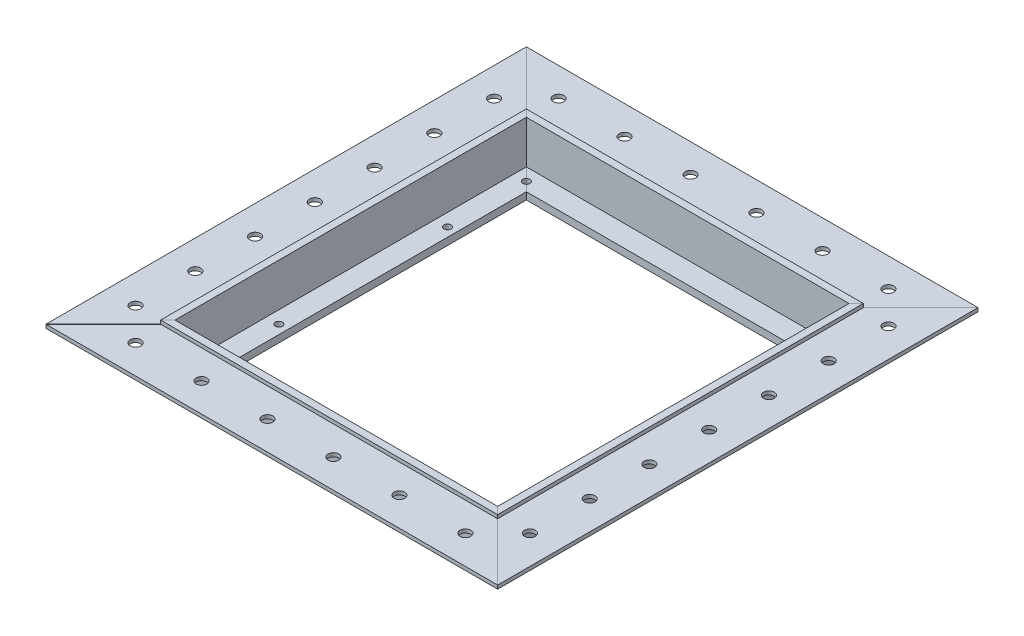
ISO-10303-21;
HEADER;
FILE_DESCRIPTION(('STEP AP214'),'2;1');
FILE_NAME('part.step','',(''),(''),'','','');
FILE_SCHEMA(('AUTOMOTIVE_DESIGN { 1 0 10303 214 1 1 1 1 }'));
ENDSEC;
DATA;
#1=APPLICATION_CONTEXT('core data for automotive mechanical design processes');
#2=APPLICATION_PROTOCOL_DEFINITION('international standard','automotive_design',2000,#1);
#3=PRODUCT_CONTEXT('',#1,'mechanical');
#4=PRODUCT('Part','Part','',(#3));
#5=PRODUCT_RELATED_PRODUCT_CATEGORY('part','',(#4));
#6=PRODUCT_DEFINITION_FORMATION('','',#4);
#7=PRODUCT_DEFINITION_CONTEXT('part definition',#1,'design');
#8=PRODUCT_DEFINITION('design','',#6,#7);
#9=PRODUCT_DEFINITION_SHAPE('','',#8);
#10=(LENGTH_UNIT() NAMED_UNIT(*) SI_UNIT(.MILLI.,.METRE.));
#11=(NAMED_UNIT(*) PLANE_ANGLE_UNIT() SI_UNIT($,.RADIAN.));
#12=(NAMED_UNIT(*) SI_UNIT($,.STERADIAN.) SOLID_ANGLE_UNIT());
#13=UNCERTAINTY_MEASURE_WITH_UNIT(LENGTH_MEASURE(1.E-05),#10,'distance_accuracy_value','');
#14=(GEOMETRIC_REPRESENTATION_CONTEXT(3) GLOBAL_UNCERTAINTY_ASSIGNED_CONTEXT((#13)) GLOBAL_UNIT_ASSIGNED_CONTEXT((#10,
#11,#12)) REPRESENTATION_CONTEXT('',''));
#15=CARTESIAN_POINT('',(0.,0.,0.));
#16=DIRECTION('',(0.,0.,1.));
#17=DIRECTION('',(1.,0.,0.));
#18=AXIS2_PLACEMENT_3D('',#15,#16,#17);
#19=CARTESIAN_POINT('',(161.942960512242,-2.18575157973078E-13,-106.344539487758));
#20=DIRECTION('',(0.707106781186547,0.,0.707106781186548));
#21=DIRECTION('',(0.707106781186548,0.,-0.707106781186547));
#22=AXIS2_PLACEMENT_3D('',#19,#20,#21);
#23=PLANE('',#22);
#24=DIRECTION('',(0.707106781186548,0.,-0.707106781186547));
#25=VECTOR('',#24,1.);
#26=CARTESIAN_POINT('',(161.942960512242,-2.18575157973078E-13,-106.344539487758));
#27=LINE('',#26,#25);
#28=CARTESIAN_POINT('',(128.934098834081,-1.97932552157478E-13,-73.3356778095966));
#29=VERTEX_POINT('',#28);
#30=CARTESIAN_POINT('',(136.525,-1.90376777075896E-13,-80.9265789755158));
#31=VERTEX_POINT('',#30);
#32=EDGE_CURVE('E203',#29,#31,#27,.T.);
#33=ORIENTED_EDGE('',*,*,#32,.F.);
#34=DIRECTION('',(0.,1.,0.));
#35=VECTOR('',#34,1.);
#36=CARTESIAN_POINT('',(128.934098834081,-1.97956267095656E-13,-73.3356778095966));
#37=LINE('',#36,#35);
#38=CARTESIAN_POINT('',(128.934098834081,3.17500000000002,-73.3356778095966));
#39=VERTEX_POINT('',#38);
#40=EDGE_CURVE('E12',#29,#39,#37,.T.);
#41=ORIENTED_EDGE('',*,*,#40,.T.);
#42=DIRECTION('',(-0.707106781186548,0.,0.707106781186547));
#43=VECTOR('',#42,1.);
#44=CARTESIAN_POINT('',(-11.094539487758,3.17499999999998,66.692960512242));
#45=LINE('',#44,#43);
#46=CARTESIAN_POINT('',(133.35,3.17500000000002,-77.7515789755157));
#47=VERTEX_POINT('',#46);
#48=EDGE_CURVE('E244',#47,#39,#45,.T.);
#49=ORIENTED_EDGE('',*,*,#48,.F.);
#50=DIRECTION('',(0.,-1.,0.));
#51=VECTOR('',#50,1.);
#52=CARTESIAN_POINT('',(133.35,-2.50943578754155E-13,-77.7515789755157));
#53=LINE('',#52,#51);
#54=CARTESIAN_POINT('',(133.35,22.225,-77.7515789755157));
#55=VERTEX_POINT('',#54);
#56=EDGE_CURVE('E279',#55,#47,#53,.T.);
#57=ORIENTED_EDGE('',*,*,#56,.F.);
#58=DIRECTION('',(0.707106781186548,0.,-0.707106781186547));
#59=VECTOR('',#58,1.);
#60=CARTESIAN_POINT('',(161.942960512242,22.225,-106.344539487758));
#61=LINE('',#60,#59);
#62=CARTESIAN_POINT('',(136.525,22.225,-80.9265789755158));
#63=VERTEX_POINT('',#62);
#64=EDGE_CURVE('E183',#55,#63,#61,.T.);
#65=ORIENTED_EDGE('',*,*,#64,.T.);
#66=DIRECTION('',(0.,1.,0.));
#67=VECTOR('',#66,1.);
#68=CARTESIAN_POINT('',(136.525,1.73433095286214E-13,-80.9265789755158));
#69=LINE('',#68,#67);
#70=CARTESIAN_POINT('',(136.525,20.6375,-80.9265789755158));
#71=VERTEX_POINT('',#70);
#72=EDGE_CURVE('E231',#71,#63,#69,.T.);
#73=ORIENTED_EDGE('',*,*,#72,.F.);
#74=DIRECTION('',(-0.707106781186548,0.,0.707106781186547));
#75=VECTOR('',#74,1.);
#76=CARTESIAN_POINT('',(-11.0945394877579,20.6375,66.692960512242));
#77=LINE('',#76,#75);
#78=CARTESIAN_POINT('',(161.925,20.6375,-106.326578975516));
#79=VERTEX_POINT('',#78);
#80=EDGE_CURVE('E227',#79,#71,#77,.T.);
#81=ORIENTED_EDGE('',*,*,#80,.F.);
#82=DIRECTION('',(0.,1.,0.));
#83=VECTOR('',#82,1.);
#84=CARTESIAN_POINT('',(161.925,2.01188670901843E-13,-106.326578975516));
#85=LINE('',#84,#83);
#86=CARTESIAN_POINT('',(161.925,19.05,-106.326578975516));
#87=VERTEX_POINT('',#86);
#88=EDGE_CURVE('E223',#87,#79,#85,.T.);
#89=ORIENTED_EDGE('',*,*,#88,.F.);
#90=DIRECTION('',(0.707106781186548,0.,-0.707106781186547));
#91=VECTOR('',#90,1.);
#92=CARTESIAN_POINT('',(-11.0945394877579,19.05,66.692960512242));
#93=LINE('',#92,#91);
#94=CARTESIAN_POINT('',(136.525,19.05,-80.9265789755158));
#95=VERTEX_POINT('',#94);
#96=EDGE_CURVE('E219',#95,#87,#93,.T.);
#97=ORIENTED_EDGE('',*,*,#96,.F.);
#98=DIRECTION('',(0.,1.,0.));
#99=VECTOR('',#98,1.);
#100=CARTESIAN_POINT('',(136.525,1.73433095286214E-13,-80.9265789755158));
#101=LINE('',#100,#99);
#102=EDGE_CURVE('E172',#31,#95,#101,.T.);
#103=ORIENTED_EDGE('',*,*,#102,.F.);
#104=EDGE_LOOP('',(#33,#41,#49,#57,#65,#73,#81,#89,#97,#103));
#105=FACE_BOUND('',#104,.T.);
#106=ADVANCED_FACE('F49',(#105),#23,.F.);
#107=CARTESIAN_POINT('',(161.942960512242,-2.18575157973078E-13,106.344539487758));
#108=DIRECTION('',(0.707106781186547,0.,-0.707106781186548));
#109=DIRECTION('',(-0.707106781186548,0.,-0.707106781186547));
#110=AXIS2_PLACEMENT_3D('',#107,#108,#109);
#111=PLANE('',#110);
#112=DIRECTION('',(-0.707106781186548,0.,-0.707106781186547));
#113=VECTOR('',#112,1.);
#114=CARTESIAN_POINT('',(161.942960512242,-2.18575157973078E-13,106.344539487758));
#115=LINE('',#114,#113);
#116=CARTESIAN_POINT('',(126.689322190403,-1.98443584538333E-13,71.0909011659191));
#117=VERTEX_POINT('',#116);
#118=CARTESIAN_POINT('',(123.825,-1.76287549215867E-13,68.2265789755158));
#119=VERTEX_POINT('',#118);
#120=EDGE_CURVE('E186',#117,#119,#115,.T.);
#121=ORIENTED_EDGE('',*,*,#120,.F.);
#122=DIRECTION('',(0.,1.,0.));
#123=VECTOR('',#122,1.);
#124=CARTESIAN_POINT('',(126.689322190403,-1.98467299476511E-13,71.0909011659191));
#125=LINE('',#124,#123);
#126=CARTESIAN_POINT('',(126.689322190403,3.17500000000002,71.0909011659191));
#127=VERTEX_POINT('',#126);
#128=EDGE_CURVE('E155',#117,#127,#125,.T.);
#129=ORIENTED_EDGE('',*,*,#128,.T.);
#130=DIRECTION('',(0.707106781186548,0.,0.707106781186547));
#131=VECTOR('',#130,1.);
#132=CARTESIAN_POINT('',(66.692960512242,3.175,11.0945394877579));
#133=LINE('',#132,#131);
#134=CARTESIAN_POINT('',(123.825,3.17500000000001,68.2265789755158));
#135=VERTEX_POINT('',#134);
#136=EDGE_CURVE('E165',#135,#127,#133,.T.);
#137=ORIENTED_EDGE('',*,*,#136,.F.);
#138=DIRECTION('',(0.,1.,0.));
#139=VECTOR('',#138,1.);
#140=CARTESIAN_POINT('',(123.825,0.,68.2265789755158));
#141=LINE('',#140,#139);
#142=EDGE_CURVE('E180',#119,#135,#141,.T.);
#143=ORIENTED_EDGE('',*,*,#142,.F.);
#144=EDGE_LOOP('',(#121,#129,#137,#143));
#145=FACE_BOUND('',#144,.T.);
#146=ADVANCED_FACE('F289',(#145),#111,.F.);
#147=CARTESIAN_POINT('',(0.,22.2250000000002,77.7875));
#148=DIRECTION('',(0.,-1.,0.));
#149=DIRECTION('',(1.,0.,0.));
#150=AXIS2_PLACEMENT_3D('',#147,#148,#149);
#151=PLANE('',#150);
#152=DIRECTION('',(0.,0.,-1.));
#153=VECTOR('',#152,1.);
#154=CARTESIAN_POINT('',(133.35,22.225,77.7875));
#155=LINE('',#154,#153);
#156=CARTESIAN_POINT('',(133.35,22.225,77.7515789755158));
#157=VERTEX_POINT('',#156);
#158=EDGE_CURVE('E250',#157,#55,#155,.T.);
#159=ORIENTED_EDGE('',*,*,#158,.F.);
#160=DIRECTION('',(-0.707106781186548,0.,-0.707106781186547));
#161=VECTOR('',#160,1.);
#162=CARTESIAN_POINT('',(161.942960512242,22.225,106.344539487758));
#163=LINE('',#162,#161);
#164=CARTESIAN_POINT('',(136.525,22.225,80.9265789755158));
#165=VERTEX_POINT('',#164);
#166=EDGE_CURVE('E156',#165,#157,#163,.T.);
#167=ORIENTED_EDGE('',*,*,#166,.F.);
#168=DIRECTION('',(0.,0.,-1.));
#169=VECTOR('',#168,1.);
#170=CARTESIAN_POINT('',(136.525,22.225,77.7875));
#171=LINE('',#170,#169);
#172=EDGE_CURVE('E261',#165,#63,#171,.T.);
#173=ORIENTED_EDGE('',*,*,#172,.T.);
#174=ORIENTED_EDGE('',*,*,#64,.F.);
#175=EDGE_LOOP('',(#159,#167,#173,#174));
#176=FACE_BOUND('',#175,.T.);
#177=ADVANCED_FACE('F51',(#176),#151,.F.);
#178=CARTESIAN_POINT('',(123.825,0.,77.7875));
#179=DIRECTION('',(1.,0.,0.));
#180=DIRECTION('',(0.,0.,-1.));
#181=AXIS2_PLACEMENT_3D('',#178,#179,#180);
#182=PLANE('',#181);
#183=DIRECTION('',(0.,0.,-1.));
#184=VECTOR('',#183,1.);
#185=CARTESIAN_POINT('',(123.825,0.,77.7875));
#186=LINE('',#185,#184);
#187=CARTESIAN_POINT('',(123.825,-1.76287549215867E-13,-68.2265789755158));
#188=VERTEX_POINT('',#187);
#189=EDGE_CURVE('E185',#119,#188,#186,.T.);
#190=ORIENTED_EDGE('',*,*,#189,.F.);
#191=ORIENTED_EDGE('',*,*,#142,.T.);
#192=DIRECTION('',(0.,0.,-1.));
#193=VECTOR('',#192,1.);
#194=CARTESIAN_POINT('',(123.825,3.17500000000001,77.7875));
#195=LINE('',#194,#193);
#196=CARTESIAN_POINT('',(123.825,3.17500000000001,-68.2265789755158));
#197=VERTEX_POINT('',#196);
#198=EDGE_CURVE('E243',#135,#197,#195,.T.);
#199=ORIENTED_EDGE('',*,*,#198,.T.);
#200=DIRECTION('',(0.,-1.,0.));
#201=VECTOR('',#200,1.);
#202=CARTESIAN_POINT('',(123.825,1.59555307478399E-13,-68.2265789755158));
#203=LINE('',#202,#201);
#204=EDGE_CURVE('E213',#197,#188,#203,.T.);
#205=ORIENTED_EDGE('',*,*,#204,.T.);
#206=EDGE_LOOP('',(#190,#191,#199,#205));
#207=FACE_BOUND('',#206,.T.);
#208=ADVANCED_FACE('F288',(#207),#182,.F.);
#209=CARTESIAN_POINT('',(136.525,0.,77.7875));
#210=DIRECTION('',(-1.,0.,0.));
#211=DIRECTION('',(0.,0.,1.));
#212=AXIS2_PLACEMENT_3D('',#209,#210,#211);
#213=PLANE('',#212);
#214=DIRECTION('',(0.,0.,-1.));
#215=VECTOR('',#214,1.);
#216=CARTESIAN_POINT('',(136.525,19.05,77.7875));
#217=LINE('',#216,#215);
#218=CARTESIAN_POINT('',(136.525,19.05,80.9265789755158));
#219=VERTEX_POINT('',#218);
#220=EDGE_CURVE('E206',#219,#95,#217,.T.);
#221=ORIENTED_EDGE('',*,*,#220,.F.);
#222=DIRECTION('',(0.,-1.,0.));
#223=VECTOR('',#222,1.);
#224=CARTESIAN_POINT('',(136.525,0.,80.9265789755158));
#225=LINE('',#224,#223);
#226=CARTESIAN_POINT('',(136.525,-1.90376777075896E-13,80.9265789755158));
#227=VERTEX_POINT('',#226);
#228=EDGE_CURVE('E211',#219,#227,#225,.T.);
#229=ORIENTED_EDGE('',*,*,#228,.T.);
#230=DIRECTION('',(0.,0.,-1.));
#231=VECTOR('',#230,1.);
#232=CARTESIAN_POINT('',(136.525,0.,77.7875));
#233=LINE('',#232,#231);
#234=EDGE_CURVE('E176',#227,#31,#233,.T.);
#235=ORIENTED_EDGE('',*,*,#234,.T.);
#236=ORIENTED_EDGE('',*,*,#102,.T.);
#237=EDGE_LOOP('',(#221,#229,#235,#236));
#238=FACE_BOUND('',#237,.T.);
#239=ADVANCED_FACE('F293',(#238),#213,.F.);
#240=CARTESIAN_POINT('',(0.,3.17499999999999,77.7875));
#241=DIRECTION('',(0.,-1.,0.));
#242=DIRECTION('',(1.,0.,0.));
#243=AXIS2_PLACEMENT_3D('',#240,#241,#242);
#244=PLANE('',#243);
#245=CARTESIAN_POINT('',(127.79375,3.17500000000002,37.30625));
#246=DIRECTION('',(0.,1.,0.));
#247=DIRECTION('',(-1.,0.,0.));
#248=AXIS2_PLACEMENT_3D('',#245,#246,#247);
#249=CIRCLE('',#248,1.58749999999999);
#250=CARTESIAN_POINT('',(126.20625,3.17500000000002,37.30625));
#251=VERTEX_POINT('',#250);
#252=EDGE_CURVE('E573',#251,#251,#249,.T.);
#253=ORIENTED_EDGE('',*,*,#252,.F.);
#254=EDGE_LOOP('',(#253));
#255=FACE_BOUND('',#254,.T.);
#256=CARTESIAN_POINT('',(127.79375,3.17500000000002,-37.30625));
#257=DIRECTION('',(0.,1.,0.));
#258=DIRECTION('',(-1.,0.,0.));
#259=AXIS2_PLACEMENT_3D('',#256,#257,#258);
#260=CIRCLE('',#259,1.58749999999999);
#261=CARTESIAN_POINT('',(126.20625,3.17500000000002,-37.30625));
#262=VERTEX_POINT('',#261);
#263=EDGE_CURVE('E576',#262,#262,#260,.T.);
#264=ORIENTED_EDGE('',*,*,#263,.F.);
#265=EDGE_LOOP('',(#264));
#266=FACE_BOUND('',#265,.T.);
#267=ORIENTED_EDGE('',*,*,#48,.T.);
#268=CARTESIAN_POINT('',(127.79375,3.17500000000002,-72.23125));
#269=DIRECTION('',(0.,1.,0.));
#270=DIRECTION('',(-1.,0.,0.));
#271=AXIS2_PLACEMENT_3D('',#268,#269,#270);
#272=CIRCLE('',#271,1.58749999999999);
#273=CARTESIAN_POINT('',(126.689322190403,3.17500000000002,-71.0909011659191));
#274=VERTEX_POINT('',#273);
#275=EDGE_CURVE('E634',#274,#39,#272,.T.);
#276=ORIENTED_EDGE('',*,*,#275,.F.);
#277=EDGE_CURVE('E196',#274,#197,#45,.T.);
#278=ORIENTED_EDGE('',*,*,#277,.T.);
#279=ORIENTED_EDGE('',*,*,#198,.F.);
#280=ORIENTED_EDGE('',*,*,#136,.T.);
#281=CARTESIAN_POINT('',(127.79375,3.17500000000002,72.23125));
#282=DIRECTION('',(0.,1.,0.));
#283=DIRECTION('',(-1.,0.,0.));
#284=AXIS2_PLACEMENT_3D('',#281,#282,#283);
#285=CIRCLE('',#284,1.58749999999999);
#286=CARTESIAN_POINT('',(128.934098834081,3.17500000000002,73.3356778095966));
#287=VERTEX_POINT('',#286);
#288=EDGE_CURVE('E150',#287,#127,#285,.T.);
#289=ORIENTED_EDGE('',*,*,#288,.F.);
#290=CARTESIAN_POINT('',(133.35,3.17500000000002,77.7515789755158));
#291=VERTEX_POINT('',#290);
#292=EDGE_CURVE('E162',#287,#291,#133,.T.);
#293=ORIENTED_EDGE('',*,*,#292,.T.);
#294=DIRECTION('',(0.,0.,-1.));
#295=VECTOR('',#294,1.);
#296=CARTESIAN_POINT('',(133.35,3.17500000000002,77.7875));
#297=LINE('',#296,#295);
#298=EDGE_CURVE('E174',#291,#47,#297,.T.);
#299=ORIENTED_EDGE('',*,*,#298,.T.);
#300=EDGE_LOOP('',(#267,#276,#278,#279,#280,#289,#293,#299));
#301=FACE_BOUND('',#300,.T.);
#302=ADVANCED_FACE('F161',(#255,#266,#301),#244,.F.);
#303=CARTESIAN_POINT('',(0.,0.,77.7875));
#304=DIRECTION('',(0.,1.,0.));
#305=DIRECTION('',(-1.,0.,0.));
#306=AXIS2_PLACEMENT_3D('',#303,#304,#305);
#307=PLANE('',#306);
#308=CARTESIAN_POINT('',(127.79375,-1.9819215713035E-13,37.30625));
#309=DIRECTION('',(0.,1.,0.));
#310=DIRECTION('',(-1.,0.,0.));
#311=AXIS2_PLACEMENT_3D('',#308,#309,#310);
#312=CIRCLE('',#311,1.58749999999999);
#313=CARTESIAN_POINT('',(126.20625,-1.98553557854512E-13,37.30625));
#314=VERTEX_POINT('',#313);
#315=EDGE_CURVE('E166',#314,#314,#312,.T.);
#316=ORIENTED_EDGE('',*,*,#315,.T.);
#317=EDGE_LOOP('',(#316));
#318=FACE_BOUND('',#317,.T.);
#319=CARTESIAN_POINT('',(127.79375,-1.9819215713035E-13,-37.30625));
#320=DIRECTION('',(0.,1.,0.));
#321=DIRECTION('',(-1.,0.,0.));
#322=AXIS2_PLACEMENT_3D('',#319,#320,#321);
#323=CIRCLE('',#322,1.58749999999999);
#324=CARTESIAN_POINT('',(126.20625,-1.98553557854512E-13,-37.30625));
#325=VERTEX_POINT('',#324);
#326=EDGE_CURVE('E578',#325,#325,#323,.T.);
#327=ORIENTED_EDGE('',*,*,#326,.T.);
#328=EDGE_LOOP('',(#327));
#329=FACE_BOUND('',#328,.T.);
#330=CARTESIAN_POINT('',(126.689322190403,-1.79465193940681E-13,-71.0909011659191));
#331=VERTEX_POINT('',#330);
#332=EDGE_CURVE('E194',#188,#331,#27,.T.);
#333=ORIENTED_EDGE('',*,*,#332,.T.);
#334=CARTESIAN_POINT('',(127.79375,-1.9819215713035E-13,-72.23125));
#335=DIRECTION('',(0.,1.,0.));
#336=DIRECTION('',(-1.,0.,0.));
#337=AXIS2_PLACEMENT_3D('',#334,#335,#336);
#338=CIRCLE('',#337,1.58749999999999);
#339=EDGE_CURVE('E64',#331,#29,#338,.T.);
#340=ORIENTED_EDGE('',*,*,#339,.T.);
#341=ORIENTED_EDGE('',*,*,#32,.T.);
#342=ORIENTED_EDGE('',*,*,#234,.F.);
#343=CARTESIAN_POINT('',(128.934098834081,-1.81955522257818E-13,73.3356778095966));
#344=VERTEX_POINT('',#343);
#345=EDGE_CURVE('E184',#227,#344,#115,.T.);
#346=ORIENTED_EDGE('',*,*,#345,.T.);
#347=CARTESIAN_POINT('',(127.79375,-1.9819215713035E-13,72.23125));
#348=DIRECTION('',(0.,1.,0.));
#349=DIRECTION('',(-1.,0.,0.));
#350=AXIS2_PLACEMENT_3D('',#347,#348,#349);
#351=CIRCLE('',#350,1.58749999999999);
#352=EDGE_CURVE('E72',#344,#117,#351,.T.);
#353=ORIENTED_EDGE('',*,*,#352,.T.);
#354=ORIENTED_EDGE('',*,*,#120,.T.);
#355=ORIENTED_EDGE('',*,*,#189,.T.);
#356=EDGE_LOOP('',(#333,#340,#341,#342,#346,#353,#354,#355));
#357=FACE_BOUND('',#356,.T.);
#358=ADVANCED_FACE('F199',(#318,#329,#357),#307,.F.);
#359=CARTESIAN_POINT('',(0.,19.05,77.7875));
#360=DIRECTION('',(0.,1.,0.));
#361=DIRECTION('',(0.,0.,1.));
#362=AXIS2_PLACEMENT_3D('',#359,#360,#361);
#363=PLANE('',#362);
#364=CARTESIAN_POINT('',(149.225,19.05,-79.375));
#365=DIRECTION('',(0.,1.,0.));
#366=DIRECTION('',(0.,0.,1.));
#367=AXIS2_PLACEMENT_3D('',#364,#365,#366);
#368=CIRCLE('',#367,2.38125);
#369=CARTESIAN_POINT('',(149.225,19.05,-76.99375));
#370=VERTEX_POINT('',#369);
#371=EDGE_CURVE('E262',#370,#370,#368,.T.);
#372=ORIENTED_EDGE('',*,*,#371,.T.);
#373=EDGE_LOOP('',(#372));
#374=FACE_BOUND('',#373,.T.);
#375=CARTESIAN_POINT('',(149.225,19.05,-52.916666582));
#376=DIRECTION('',(0.,1.,0.));
#377=DIRECTION('',(0.,0.,1.));
#378=AXIS2_PLACEMENT_3D('',#375,#376,#377);
#379=CIRCLE('',#378,2.38125);
#380=CARTESIAN_POINT('',(149.225,19.05,-50.535416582));
#381=VERTEX_POINT('',#380);
#382=EDGE_CURVE('E269',#381,#381,#379,.T.);
#383=ORIENTED_EDGE('',*,*,#382,.T.);
#384=EDGE_LOOP('',(#383));
#385=FACE_BOUND('',#384,.T.);
#386=CARTESIAN_POINT('',(149.225,19.05,-26.458333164));
#387=DIRECTION('',(0.,1.,0.));
#388=DIRECTION('',(0.,0.,1.));
#389=AXIS2_PLACEMENT_3D('',#386,#387,#388);
#390=CIRCLE('',#389,2.38125000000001);
#391=CARTESIAN_POINT('',(149.225,19.05,-24.077083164));
#392=VERTEX_POINT('',#391);
#393=EDGE_CURVE('E274',#392,#392,#390,.T.);
#394=ORIENTED_EDGE('',*,*,#393,.T.);
#395=EDGE_LOOP('',(#394));
#396=FACE_BOUND('',#395,.T.);
#397=CARTESIAN_POINT('',(149.225,19.05,2.54000001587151E-07));
#398=DIRECTION('',(0.,1.,0.));
#399=DIRECTION('',(0.,0.,1.));
#400=AXIS2_PLACEMENT_3D('',#397,#398,#399);
#401=CIRCLE('',#400,2.38124999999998);
#402=CARTESIAN_POINT('',(149.225,19.05,2.38125025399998));
#403=VERTEX_POINT('',#402);
#404=EDGE_CURVE('E614',#403,#403,#401,.T.);
#405=ORIENTED_EDGE('',*,*,#404,.T.);
#406=EDGE_LOOP('',(#405));
#407=FACE_BOUND('',#406,.T.);
#408=CARTESIAN_POINT('',(149.225,19.05,26.458333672));
#409=DIRECTION('',(0.,1.,0.));
#410=DIRECTION('',(0.,0.,1.));
#411=AXIS2_PLACEMENT_3D('',#408,#409,#410);
#412=CIRCLE('',#411,2.38124999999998);
#413=CARTESIAN_POINT('',(149.225,19.05,28.839583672));
#414=VERTEX_POINT('',#413);
#415=EDGE_CURVE('E611',#414,#414,#412,.T.);
#416=ORIENTED_EDGE('',*,*,#415,.T.);
#417=EDGE_LOOP('',(#416));
#418=FACE_BOUND('',#417,.T.);
#419=CARTESIAN_POINT('',(149.225,19.05,52.91666709));
#420=DIRECTION('',(0.,1.,0.));
#421=DIRECTION('',(0.,0.,1.));
#422=AXIS2_PLACEMENT_3D('',#419,#420,#421);
#423=CIRCLE('',#422,2.38124999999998);
#424=CARTESIAN_POINT('',(149.225,19.05,55.29791709));
#425=VERTEX_POINT('',#424);
#426=EDGE_CURVE('E608',#425,#425,#423,.T.);
#427=ORIENTED_EDGE('',*,*,#426,.T.);
#428=EDGE_LOOP('',(#427));
#429=FACE_BOUND('',#428,.T.);
#430=CARTESIAN_POINT('',(149.225,19.05,79.375000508));
#431=DIRECTION('',(0.,1.,0.));
#432=DIRECTION('',(0.,0.,1.));
#433=AXIS2_PLACEMENT_3D('',#430,#431,#432);
#434=CIRCLE('',#433,2.38125000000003);
#435=CARTESIAN_POINT('',(149.225,19.05,81.756250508));
#436=VERTEX_POINT('',#435);
#437=EDGE_CURVE('E587',#436,#436,#434,.T.);
#438=ORIENTED_EDGE('',*,*,#437,.T.);
#439=EDGE_LOOP('',(#438));
#440=FACE_BOUND('',#439,.T.);
#441=DIRECTION('',(0.,0.,-1.));
#442=VECTOR('',#441,1.);
#443=CARTESIAN_POINT('',(161.925,19.05,77.7875));
#444=LINE('',#443,#442);
#445=CARTESIAN_POINT('',(161.925,19.05,106.326578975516));
#446=VERTEX_POINT('',#445);
#447=EDGE_CURVE('E218',#446,#87,#444,.T.);
#448=ORIENTED_EDGE('',*,*,#447,.F.);
#449=DIRECTION('',(-0.707106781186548,0.,-0.707106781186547));
#450=VECTOR('',#449,1.);
#451=CARTESIAN_POINT('',(66.6929605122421,19.05,11.0945394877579));
#452=LINE('',#451,#450);
#453=EDGE_CURVE('E202',#446,#219,#452,.T.);
#454=ORIENTED_EDGE('',*,*,#453,.T.);
#455=ORIENTED_EDGE('',*,*,#220,.T.);
#456=ORIENTED_EDGE('',*,*,#96,.T.);
#457=EDGE_LOOP('',(#448,#454,#455,#456));
#458=FACE_BOUND('',#457,.T.);
#459=ADVANCED_FACE('F322',(#374,#385,#396,#407,#418,#429,#440,#458),#363,.F.);
#460=CARTESIAN_POINT('',(161.925,0.,77.7875));
#461=DIRECTION('',(-1.,0.,0.));
#462=DIRECTION('',(0.,0.,1.));
#463=AXIS2_PLACEMENT_3D('',#460,#461,#462);
#464=PLANE('',#463);
#465=DIRECTION('',(0.,0.,-1.));
#466=VECTOR('',#465,1.);
#467=CARTESIAN_POINT('',(161.925,20.6375,77.7875));
#468=LINE('',#467,#466);
#469=CARTESIAN_POINT('',(161.925,20.6375,106.326578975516));
#470=VERTEX_POINT('',#469);
#471=EDGE_CURVE('E222',#470,#79,#468,.T.);
#472=ORIENTED_EDGE('',*,*,#471,.F.);
#473=DIRECTION('',(0.,-1.,0.));
#474=VECTOR('',#473,1.);
#475=CARTESIAN_POINT('',(161.925,0.,106.326578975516));
#476=LINE('',#475,#474);
#477=EDGE_CURVE('E215',#470,#446,#476,.T.);
#478=ORIENTED_EDGE('',*,*,#477,.T.);
#479=ORIENTED_EDGE('',*,*,#447,.T.);
#480=ORIENTED_EDGE('',*,*,#88,.T.);
#481=EDGE_LOOP('',(#472,#478,#479,#480));
#482=FACE_BOUND('',#481,.T.);
#483=ADVANCED_FACE('F319',(#482),#464,.F.);
#484=CARTESIAN_POINT('',(0.,20.6375,77.7875));
#485=DIRECTION('',(0.,-1.,0.));
#486=DIRECTION('',(1.,0.,0.));
#487=AXIS2_PLACEMENT_3D('',#484,#485,#486);
#488=PLANE('',#487);
#489=CARTESIAN_POINT('',(149.225,20.6375,-79.375));
#490=DIRECTION('',(0.,1.,0.));
#491=DIRECTION('',(1.,0.,0.));
#492=AXIS2_PLACEMENT_3D('',#489,#490,#491);
#493=CIRCLE('',#492,2.38125);
#494=CARTESIAN_POINT('',(151.60625,20.6375,-79.375));
#495=VERTEX_POINT('',#494);
#496=EDGE_CURVE('E584',#495,#495,#493,.T.);
#497=ORIENTED_EDGE('',*,*,#496,.F.);
#498=EDGE_LOOP('',(#497));
#499=FACE_BOUND('',#498,.T.);
#500=CARTESIAN_POINT('',(149.225,20.6375,-52.916666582));
#501=DIRECTION('',(0.,1.,0.));
#502=DIRECTION('',(1.,0.,0.));
#503=AXIS2_PLACEMENT_3D('',#500,#501,#502);
#504=CIRCLE('',#503,2.38125);
#505=CARTESIAN_POINT('',(151.60625,20.6375,-52.916666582));
#506=VERTEX_POINT('',#505);
#507=EDGE_CURVE('E588',#506,#506,#504,.T.);
#508=ORIENTED_EDGE('',*,*,#507,.F.);
#509=EDGE_LOOP('',(#508));
#510=FACE_BOUND('',#509,.T.);
#511=CARTESIAN_POINT('',(149.225,20.6375,-26.458333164));
#512=DIRECTION('',(0.,1.,0.));
#513=DIRECTION('',(1.,0.,0.));
#514=AXIS2_PLACEMENT_3D('',#511,#512,#513);
#515=CIRCLE('',#514,2.38125000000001);
#516=CARTESIAN_POINT('',(151.60625,20.6375,-26.458333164));
#517=VERTEX_POINT('',#516);
#518=EDGE_CURVE('E591',#517,#517,#515,.T.);
#519=ORIENTED_EDGE('',*,*,#518,.F.);
#520=EDGE_LOOP('',(#519));
#521=FACE_BOUND('',#520,.T.);
#522=CARTESIAN_POINT('',(149.225,20.6375,2.54000001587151E-07));
#523=DIRECTION('',(0.,1.,0.));
#524=DIRECTION('',(1.,0.,0.));
#525=AXIS2_PLACEMENT_3D('',#522,#523,#524);
#526=CIRCLE('',#525,2.38124999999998);
#527=CARTESIAN_POINT('',(151.60625,20.6375,2.54000001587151E-07));
#528=VERTEX_POINT('',#527);
#529=EDGE_CURVE('E594',#528,#528,#526,.T.);
#530=ORIENTED_EDGE('',*,*,#529,.F.);
#531=EDGE_LOOP('',(#530));
#532=FACE_BOUND('',#531,.T.);
#533=CARTESIAN_POINT('',(149.225,20.6375,26.458333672));
#534=DIRECTION('',(0.,1.,0.));
#535=DIRECTION('',(1.,0.,0.));
#536=AXIS2_PLACEMENT_3D('',#533,#534,#535);
#537=CIRCLE('',#536,2.38124999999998);
#538=CARTESIAN_POINT('',(151.60625,20.6375,26.458333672));
#539=VERTEX_POINT('',#538);
#540=EDGE_CURVE('E597',#539,#539,#537,.T.);
#541=ORIENTED_EDGE('',*,*,#540,.F.);
#542=EDGE_LOOP('',(#541));
#543=FACE_BOUND('',#542,.T.);
#544=CARTESIAN_POINT('',(149.225,20.6375,52.91666709));
#545=DIRECTION('',(0.,1.,0.));
#546=DIRECTION('',(1.,0.,0.));
#547=AXIS2_PLACEMENT_3D('',#544,#545,#546);
#548=CIRCLE('',#547,2.38124999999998);
#549=CARTESIAN_POINT('',(151.60625,20.6375,52.91666709));
#550=VERTEX_POINT('',#549);
#551=EDGE_CURVE('E600',#550,#550,#548,.T.);
#552=ORIENTED_EDGE('',*,*,#551,.F.);
#553=EDGE_LOOP('',(#552));
#554=FACE_BOUND('',#553,.T.);
#555=CARTESIAN_POINT('',(149.225,20.6375,79.375000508));
#556=DIRECTION('',(0.,1.,0.));
#557=DIRECTION('',(1.,0.,0.));
#558=AXIS2_PLACEMENT_3D('',#555,#556,#557);
#559=CIRCLE('',#558,2.38125000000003);
#560=CARTESIAN_POINT('',(151.60625,20.6375,79.375000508));
#561=VERTEX_POINT('',#560);
#562=EDGE_CURVE('E603',#561,#561,#559,.T.);
#563=ORIENTED_EDGE('',*,*,#562,.F.);
#564=EDGE_LOOP('',(#563));
#565=FACE_BOUND('',#564,.T.);
#566=DIRECTION('',(0.,0.,-1.));
#567=VECTOR('',#566,1.);
#568=CARTESIAN_POINT('',(136.525,20.6375,77.7875));
#569=LINE('',#568,#567);
#570=CARTESIAN_POINT('',(136.525,20.6375,80.9265789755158));
#571=VERTEX_POINT('',#570);
#572=EDGE_CURVE('E226',#571,#71,#569,.T.);
#573=ORIENTED_EDGE('',*,*,#572,.F.);
#574=DIRECTION('',(0.707106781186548,0.,0.707106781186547));
#575=VECTOR('',#574,1.);
#576=CARTESIAN_POINT('',(66.6929605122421,20.6375,11.0945394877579));
#577=LINE('',#576,#575);
#578=EDGE_CURVE('E220',#571,#470,#577,.T.);
#579=ORIENTED_EDGE('',*,*,#578,.T.);
#580=ORIENTED_EDGE('',*,*,#471,.T.);
#581=ORIENTED_EDGE('',*,*,#80,.T.);
#582=EDGE_LOOP('',(#573,#579,#580,#581));
#583=FACE_BOUND('',#582,.T.);
#584=ADVANCED_FACE('F316',(#499,#510,#521,#532,#543,#554,#565,#583),#488,.F.);
#585=CARTESIAN_POINT('',(136.525,0.,77.7875));
#586=DIRECTION('',(-1.,0.,0.));
#587=DIRECTION('',(0.,0.,1.));
#588=AXIS2_PLACEMENT_3D('',#585,#586,#587);
#589=PLANE('',#588);
#590=ORIENTED_EDGE('',*,*,#172,.F.);
#591=DIRECTION('',(0.,-1.,0.));
#592=VECTOR('',#591,1.);
#593=CARTESIAN_POINT('',(136.525,0.,80.9265789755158));
#594=LINE('',#593,#592);
#595=EDGE_CURVE('E224',#165,#571,#594,.T.);
#596=ORIENTED_EDGE('',*,*,#595,.T.);
#597=ORIENTED_EDGE('',*,*,#572,.T.);
#598=ORIENTED_EDGE('',*,*,#72,.T.);
#599=EDGE_LOOP('',(#590,#596,#597,#598));
#600=FACE_BOUND('',#599,.T.);
#601=ADVANCED_FACE('F312',(#600),#589,.F.);
#602=CARTESIAN_POINT('',(133.35,-1.94289029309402E-13,77.7875));
#603=DIRECTION('',(1.,0.,0.));
#604=DIRECTION('',(0.,1.,0.));
#605=AXIS2_PLACEMENT_3D('',#602,#603,#604);
#606=PLANE('',#605);
#607=ORIENTED_EDGE('',*,*,#298,.F.);
#608=DIRECTION('',(0.,1.,0.));
#609=VECTOR('',#608,1.);
#610=CARTESIAN_POINT('',(133.35,-1.9427594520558E-13,77.7515789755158));
#611=LINE('',#610,#609);
#612=EDGE_CURVE('E170',#291,#157,#611,.T.);
#613=ORIENTED_EDGE('',*,*,#612,.T.);
#614=ORIENTED_EDGE('',*,*,#158,.T.);
#615=ORIENTED_EDGE('',*,*,#56,.T.);
#616=EDGE_LOOP('',(#607,#613,#614,#615));
#617=FACE_BOUND('',#616,.T.);
#618=ADVANCED_FACE('F284',(#617),#606,.F.);
#619=ORIENTED_EDGE('',*,*,#277,.F.);
#620=DIRECTION('',(0.,1.,0.));
#621=VECTOR('',#620,1.);
#622=CARTESIAN_POINT('',(126.689322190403,-1.98467299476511E-13,-71.0909011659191));
#623=LINE('',#622,#621);
#624=EDGE_CURVE('E57',#274,#331,#623,.F.);
#625=ORIENTED_EDGE('',*,*,#624,.T.);
#626=ORIENTED_EDGE('',*,*,#332,.F.);
#627=ORIENTED_EDGE('',*,*,#204,.F.);
#628=EDGE_LOOP('',(#619,#625,#626,#627));
#629=FACE_BOUND('',#628,.T.);
#630=ADVANCED_FACE('F192',(#629),#23,.F.);
#631=ORIENTED_EDGE('',*,*,#292,.F.);
#632=DIRECTION('',(0.,1.,0.));
#633=VECTOR('',#632,1.);
#634=CARTESIAN_POINT('',(128.934098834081,-1.97956267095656E-13,73.3356778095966));
#635=LINE('',#634,#633);
#636=EDGE_CURVE('E147',#287,#344,#635,.F.);
#637=ORIENTED_EDGE('',*,*,#636,.T.);
#638=ORIENTED_EDGE('',*,*,#345,.F.);
#639=ORIENTED_EDGE('',*,*,#228,.F.);
#640=ORIENTED_EDGE('',*,*,#453,.F.);
#641=ORIENTED_EDGE('',*,*,#477,.F.);
#642=ORIENTED_EDGE('',*,*,#578,.F.);
#643=ORIENTED_EDGE('',*,*,#595,.F.);
#644=ORIENTED_EDGE('',*,*,#166,.T.);
#645=ORIENTED_EDGE('',*,*,#612,.F.);
#646=EDGE_LOOP('',(#631,#637,#638,#639,#640,#641,#642,#643,#644,#645));
#647=FACE_BOUND('',#646,.T.);
#648=ADVANCED_FACE('F168',(#647),#111,.F.);
#649=CARTESIAN_POINT('',(149.225,18.0975,79.375000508));
#650=DIRECTION('',(0.,1.,0.));
#651=DIRECTION('',(-1.,0.,0.));
#652=AXIS2_PLACEMENT_3D('',#649,#650,#651);
#653=CYLINDRICAL_SURFACE('',#652,2.38125000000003);
#654=ORIENTED_EDGE('',*,*,#562,.T.);
#655=EDGE_LOOP('',(#654));
#656=FACE_BOUND('',#655,.T.);
#657=ORIENTED_EDGE('',*,*,#437,.F.);
#658=EDGE_LOOP('',(#657));
#659=FACE_BOUND('',#658,.T.);
#660=ADVANCED_FACE('F310',(#656,#659),#653,.F.);
#661=CARTESIAN_POINT('',(149.225,18.0975,52.91666709));
#662=DIRECTION('',(0.,1.,0.));
#663=DIRECTION('',(-1.,0.,0.));
#664=AXIS2_PLACEMENT_3D('',#661,#662,#663);
#665=CYLINDRICAL_SURFACE('',#664,2.38124999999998);
#666=ORIENTED_EDGE('',*,*,#551,.T.);
#667=EDGE_LOOP('',(#666));
#668=FACE_BOUND('',#667,.T.);
#669=ORIENTED_EDGE('',*,*,#426,.F.);
#670=EDGE_LOOP('',(#669));
#671=FACE_BOUND('',#670,.T.);
#672=ADVANCED_FACE('F329',(#668,#671),#665,.F.);
#673=CARTESIAN_POINT('',(149.225,18.0975,26.458333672));
#674=DIRECTION('',(0.,1.,0.));
#675=DIRECTION('',(-1.,0.,0.));
#676=AXIS2_PLACEMENT_3D('',#673,#674,#675);
#677=CYLINDRICAL_SURFACE('',#676,2.38124999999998);
#678=ORIENTED_EDGE('',*,*,#540,.T.);
#679=EDGE_LOOP('',(#678));
#680=FACE_BOUND('',#679,.T.);
#681=ORIENTED_EDGE('',*,*,#415,.F.);
#682=EDGE_LOOP('',(#681));
#683=FACE_BOUND('',#682,.T.);
#684=ADVANCED_FACE('F333',(#680,#683),#677,.F.);
#685=CARTESIAN_POINT('',(149.225,18.0975,2.54000001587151E-07));
#686=DIRECTION('',(0.,1.,0.));
#687=DIRECTION('',(-1.,0.,0.));
#688=AXIS2_PLACEMENT_3D('',#685,#686,#687);
#689=CYLINDRICAL_SURFACE('',#688,2.38124999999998);
#690=ORIENTED_EDGE('',*,*,#529,.T.);
#691=EDGE_LOOP('',(#690));
#692=FACE_BOUND('',#691,.T.);
#693=ORIENTED_EDGE('',*,*,#404,.F.);
#694=EDGE_LOOP('',(#693));
#695=FACE_BOUND('',#694,.T.);
#696=ADVANCED_FACE('F337',(#692,#695),#689,.F.);
#697=CARTESIAN_POINT('',(149.225,18.0975,-26.458333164));
#698=DIRECTION('',(0.,1.,0.));
#699=DIRECTION('',(-1.,0.,0.));
#700=AXIS2_PLACEMENT_3D('',#697,#698,#699);
#701=CYLINDRICAL_SURFACE('',#700,2.38125000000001);
#702=ORIENTED_EDGE('',*,*,#518,.T.);
#703=EDGE_LOOP('',(#702));
#704=FACE_BOUND('',#703,.T.);
#705=ORIENTED_EDGE('',*,*,#393,.F.);
#706=EDGE_LOOP('',(#705));
#707=FACE_BOUND('',#706,.T.);
#708=ADVANCED_FACE('F341',(#704,#707),#701,.F.);
#709=CARTESIAN_POINT('',(149.225,18.0975,-52.916666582));
#710=DIRECTION('',(0.,1.,0.));
#711=DIRECTION('',(-1.,0.,0.));
#712=AXIS2_PLACEMENT_3D('',#709,#710,#711);
#713=CYLINDRICAL_SURFACE('',#712,2.38125);
#714=ORIENTED_EDGE('',*,*,#507,.T.);
#715=EDGE_LOOP('',(#714));
#716=FACE_BOUND('',#715,.T.);
#717=ORIENTED_EDGE('',*,*,#382,.F.);
#718=EDGE_LOOP('',(#717));
#719=FACE_BOUND('',#718,.T.);
#720=ADVANCED_FACE('F345',(#716,#719),#713,.F.);
#721=CARTESIAN_POINT('',(149.225,18.0975,-79.375));
#722=DIRECTION('',(0.,1.,0.));
#723=DIRECTION('',(-1.,0.,0.));
#724=AXIS2_PLACEMENT_3D('',#721,#722,#723);
#725=CYLINDRICAL_SURFACE('',#724,2.38125);
#726=ORIENTED_EDGE('',*,*,#496,.T.);
#727=EDGE_LOOP('',(#726));
#728=FACE_BOUND('',#727,.T.);
#729=ORIENTED_EDGE('',*,*,#371,.F.);
#730=EDGE_LOOP('',(#729));
#731=FACE_BOUND('',#730,.T.);
#732=ADVANCED_FACE('F349',(#728,#731),#725,.F.);
#733=CARTESIAN_POINT('',(127.79375,-1.9819215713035E-13,72.23125));
#734=DIRECTION('',(0.,1.,0.));
#735=DIRECTION('',(-1.,0.,0.));
#736=AXIS2_PLACEMENT_3D('',#733,#734,#735);
#737=CYLINDRICAL_SURFACE('',#736,1.58749999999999);
#738=ORIENTED_EDGE('',*,*,#352,.F.);
#739=ORIENTED_EDGE('',*,*,#636,.F.);
#740=ORIENTED_EDGE('',*,*,#288,.T.);
#741=ORIENTED_EDGE('',*,*,#128,.F.);
#742=EDGE_LOOP('',(#738,#739,#740,#741));
#743=FACE_BOUND('',#742,.T.);
#744=ADVANCED_FACE('F149',(#743),#737,.F.);
#745=CARTESIAN_POINT('',(127.79375,-1.9819215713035E-13,-72.23125));
#746=DIRECTION('',(0.,1.,0.));
#747=DIRECTION('',(-1.,0.,0.));
#748=AXIS2_PLACEMENT_3D('',#745,#746,#747);
#749=CYLINDRICAL_SURFACE('',#748,1.58749999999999);
#750=ORIENTED_EDGE('',*,*,#339,.F.);
#751=ORIENTED_EDGE('',*,*,#624,.F.);
#752=ORIENTED_EDGE('',*,*,#275,.T.);
#753=ORIENTED_EDGE('',*,*,#40,.F.);
#754=EDGE_LOOP('',(#750,#751,#752,#753));
#755=FACE_BOUND('',#754,.T.);
#756=ADVANCED_FACE('F358',(#755),#749,.F.);
#757=CARTESIAN_POINT('',(127.79375,-1.9819215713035E-13,-37.30625));
#758=DIRECTION('',(0.,1.,0.));
#759=DIRECTION('',(-1.,0.,0.));
#760=AXIS2_PLACEMENT_3D('',#757,#758,#759);
#761=CYLINDRICAL_SURFACE('',#760,1.58749999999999);
#762=ORIENTED_EDGE('',*,*,#326,.F.);
#763=EDGE_LOOP('',(#762));
#764=FACE_BOUND('',#763,.T.);
#765=ORIENTED_EDGE('',*,*,#263,.T.);
#766=EDGE_LOOP('',(#765));
#767=FACE_BOUND('',#766,.T.);
#768=ADVANCED_FACE('F354',(#764,#767),#761,.F.);
#769=CARTESIAN_POINT('',(127.79375,-1.9819215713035E-13,37.30625));
#770=DIRECTION('',(0.,1.,0.));
#771=DIRECTION('',(-1.,0.,0.));
#772=AXIS2_PLACEMENT_3D('',#769,#770,#771);
#773=CYLINDRICAL_SURFACE('',#772,1.58749999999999);
#774=ORIENTED_EDGE('',*,*,#315,.F.);
#775=EDGE_LOOP('',(#774));
#776=FACE_BOUND('',#775,.T.);
#777=ORIENTED_EDGE('',*,*,#252,.T.);
#778=EDGE_LOOP('',(#777));
#779=FACE_BOUND('',#778,.T.);
#780=ADVANCED_FACE('F357',(#776,#779),#773,.F.);
#781=CLOSED_SHELL('',(#106,#146,#177,#208,#239,#302,#358,#459,#483,#584,#601,#618,#630,#648,
#660,#672,#684,#696,#708,#720,#732,#744,#756,#768,#780));
#782=MANIFOLD_SOLID_BREP('B2',#781);
#783=CARTESIAN_POINT('',(-38.0820394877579,0.,106.380460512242));
#784=DIRECTION('',(0.707106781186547,0.,0.707106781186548));
#785=DIRECTION('',(0.707106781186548,0.,-0.707106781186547));
#786=AXIS2_PLACEMENT_3D('',#783,#784,#785);
#787=PLANE('',#786);
#788=DIRECTION('',(0.707106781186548,0.,-0.707106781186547));
#789=VECTOR('',#788,1.);
#790=CARTESIAN_POINT('',(-38.0820394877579,0.,106.380460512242));
#791=LINE('',#790,#789);
#792=CARTESIAN_POINT('',(-2.8284011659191,-2.27856532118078E-13,71.1268221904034));
#793=VERTEX_POINT('',#792);
#794=CARTESIAN_POINT('',(0.0359210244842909,0.,68.2625));
#795=VERTEX_POINT('',#794);
#796=EDGE_CURVE('E862',#793,#795,#791,.T.);
#797=ORIENTED_EDGE('',*,*,#796,.F.);
#798=DIRECTION('',(0.,1.,0.));
#799=VECTOR('',#798,1.);
#800=CARTESIAN_POINT('',(-2.8284011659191,-2.27880247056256E-13,71.1268221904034));
#801=LINE('',#800,#799);
#802=CARTESIAN_POINT('',(-2.8284011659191,3.17499999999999,71.1268221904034));
#803=VERTEX_POINT('',#802);
#804=EDGE_CURVE('E950',#793,#803,#801,.T.);
#805=ORIENTED_EDGE('',*,*,#804,.T.);
#806=DIRECTION('',(-0.707106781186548,0.,0.707106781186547));
#807=VECTOR('',#806,1.);
#808=CARTESIAN_POINT('',(-4.74453948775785,3.17499999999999,73.0429605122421));
#809=LINE('',#808,#807);
#810=CARTESIAN_POINT('',(0.0359210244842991,3.175,68.2625));
#811=VERTEX_POINT('',#810);
#812=EDGE_CURVE('E859',#811,#803,#809,.T.);
#813=ORIENTED_EDGE('',*,*,#812,.F.);
#814=DIRECTION('',(0.,1.,0.));
#815=VECTOR('',#814,1.);
#816=CARTESIAN_POINT('',(0.0359210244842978,0.,68.2625));
#817=LINE('',#816,#815);
#818=EDGE_CURVE('E826',#795,#811,#817,.T.);
#819=ORIENTED_EDGE('',*,*,#818,.F.);
#820=EDGE_LOOP('',(#797,#805,#813,#819));
#821=FACE_BOUND('',#820,.T.);
#822=ADVANCED_FACE('F691',(#821),#787,.F.);
#823=CARTESIAN_POINT('',(161.907039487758,-2.18575157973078E-13,106.380460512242));
#824=DIRECTION('',(-0.707106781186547,0.,0.707106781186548));
#825=DIRECTION('',(0.707106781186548,0.,0.707106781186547));
#826=AXIS2_PLACEMENT_3D('',#823,#824,#825);
#827=PLANE('',#826);
#828=DIRECTION('',(0.707106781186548,0.,0.707106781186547));
#829=VECTOR('',#828,1.);
#830=CARTESIAN_POINT('',(161.907039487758,-2.18575157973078E-13,106.380460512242));
#831=LINE('',#830,#829);
#832=CARTESIAN_POINT('',(128.898177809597,-1.97940729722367E-13,73.3715988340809));
#833=VERTEX_POINT('',#832);
#834=CARTESIAN_POINT('',(136.489078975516,-1.89842640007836E-13,80.9625));
#835=VERTEX_POINT('',#834);
#836=EDGE_CURVE('E803',#833,#835,#831,.T.);
#837=ORIENTED_EDGE('',*,*,#836,.F.);
#838=DIRECTION('',(0.,1.,0.));
#839=VECTOR('',#838,1.);
#840=CARTESIAN_POINT('',(128.898177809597,-1.97917014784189E-13,73.3715988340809));
#841=LINE('',#840,#839);
#842=CARTESIAN_POINT('',(128.898177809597,3.17500000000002,73.3715988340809));
#843=VERTEX_POINT('',#842);
#844=EDGE_CURVE('E47',#833,#843,#841,.T.);
#845=ORIENTED_EDGE('',*,*,#844,.T.);
#846=DIRECTION('',(-0.707106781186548,0.,-0.707106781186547));
#847=VECTOR('',#846,1.);
#848=CARTESIAN_POINT('',(66.6570394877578,3.175,11.1304605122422));
#849=LINE('',#848,#847);
#850=CARTESIAN_POINT('',(133.314078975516,3.17500000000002,77.7875));
#851=VERTEX_POINT('',#850);
#852=EDGE_CURVE('E800',#851,#843,#849,.T.);
#853=ORIENTED_EDGE('',*,*,#852,.F.);
#854=DIRECTION('',(0.,-1.,0.));
#855=VECTOR('',#854,1.);
#856=CARTESIAN_POINT('',(133.314078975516,-1.87310883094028E-13,77.7875));
#857=LINE('',#856,#855);
#858=CARTESIAN_POINT('',(133.314078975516,22.225,77.7875));
#859=VERTEX_POINT('',#858);
#860=EDGE_CURVE('E814',#859,#851,#857,.T.);
#861=ORIENTED_EDGE('',*,*,#860,.F.);
#862=DIRECTION('',(0.707106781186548,0.,0.707106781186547));
#863=VECTOR('',#862,1.);
#864=CARTESIAN_POINT('',(161.907039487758,22.225,106.380460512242));
#865=LINE('',#864,#863);
#866=CARTESIAN_POINT('',(136.489078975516,22.225,80.9625));
#867=VERTEX_POINT('',#866);
#868=EDGE_CURVE('E897',#859,#867,#865,.T.);
#869=ORIENTED_EDGE('',*,*,#868,.T.);
#870=DIRECTION('',(0.,1.,0.));
#871=VECTOR('',#870,1.);
#872=CARTESIAN_POINT('',(136.489078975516,-1.90780330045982E-13,80.9625));
#873=LINE('',#872,#871);
#874=CARTESIAN_POINT('',(136.489078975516,20.6375,80.9625));
#875=VERTEX_POINT('',#874);
#876=EDGE_CURVE('E918',#875,#867,#873,.T.);
#877=ORIENTED_EDGE('',*,*,#876,.F.);
#878=DIRECTION('',(-0.707106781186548,0.,-0.707106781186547));
#879=VECTOR('',#878,1.);
#880=CARTESIAN_POINT('',(66.6570394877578,20.6375,11.1304605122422));
#881=LINE('',#880,#879);
#882=CARTESIAN_POINT('',(161.889078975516,20.6375,106.3625));
#883=VERTEX_POINT('',#882);
#884=EDGE_CURVE('E906',#883,#875,#881,.T.);
#885=ORIENTED_EDGE('',*,*,#884,.F.);
#886=DIRECTION('',(0.,1.,0.));
#887=VECTOR('',#886,1.);
#888=CARTESIAN_POINT('',(161.889078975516,2.45956312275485E-12,106.3625));
#889=LINE('',#888,#887);
#890=CARTESIAN_POINT('',(161.889078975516,19.05,106.3625));
#891=VERTEX_POINT('',#890);
#892=EDGE_CURVE('E874',#891,#883,#889,.T.);
#893=ORIENTED_EDGE('',*,*,#892,.F.);
#894=DIRECTION('',(0.707106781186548,0.,0.707106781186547));
#895=VECTOR('',#894,1.);
#896=CARTESIAN_POINT('',(66.6570394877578,19.05,11.1304605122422));
#897=LINE('',#896,#895);
#898=CARTESIAN_POINT('',(136.489078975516,19.05,80.9625));
#899=VERTEX_POINT('',#898);
#900=EDGE_CURVE('E909',#899,#891,#897,.T.);
#901=ORIENTED_EDGE('',*,*,#900,.F.);
#902=DIRECTION('',(0.,1.,0.));
#903=VECTOR('',#902,1.);
#904=CARTESIAN_POINT('',(136.489078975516,-1.90780330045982E-13,80.9625));
#905=LINE('',#904,#903);
#906=EDGE_CURVE('E920',#835,#899,#905,.T.);
#907=ORIENTED_EDGE('',*,*,#906,.F.);
#908=EDGE_LOOP('',(#837,#845,#853,#861,#869,#877,#885,#893,#901,#907));
#909=FACE_BOUND('',#908,.T.);
#910=ADVANCED_FACE('F799',(#909),#827,.F.);
#911=CARTESIAN_POINT('',(-5.07317780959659,3.17499999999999,73.3715988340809));
#912=VERTEX_POINT('',#911);
#913=CARTESIAN_POINT('',(-9.48907897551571,3.17500000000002,77.7875));
#914=VERTEX_POINT('',#913);
#915=EDGE_CURVE('E838',#912,#914,#809,.T.);
#916=ORIENTED_EDGE('',*,*,#915,.F.);
#917=DIRECTION('',(0.,1.,0.));
#918=VECTOR('',#917,1.);
#919=CARTESIAN_POINT('',(-5.07317780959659,-2.28391279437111E-13,73.3715988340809));
#920=LINE('',#919,#918);
#921=CARTESIAN_POINT('',(-5.07317780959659,-2.28367564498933E-13,73.3715988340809));
#922=VERTEX_POINT('',#921);
#923=EDGE_CURVE('E706',#912,#922,#920,.F.);
#924=ORIENTED_EDGE('',*,*,#923,.T.);
#925=CARTESIAN_POINT('',(-12.6640789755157,0.,80.9625));
#926=VERTEX_POINT('',#925);
#927=EDGE_CURVE('E855',#926,#922,#791,.T.);
#928=ORIENTED_EDGE('',*,*,#927,.F.);
#929=DIRECTION('',(0.,-1.,0.));
#930=VECTOR('',#929,1.);
#931=CARTESIAN_POINT('',(-12.6640789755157,0.,80.9625));
#932=LINE('',#931,#930);
#933=CARTESIAN_POINT('',(-12.6640789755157,19.05,80.9625));
#934=VERTEX_POINT('',#933);
#935=EDGE_CURVE('E830',#934,#926,#932,.T.);
#936=ORIENTED_EDGE('',*,*,#935,.F.);
#937=DIRECTION('',(0.707106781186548,0.,-0.707106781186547));
#938=VECTOR('',#937,1.);
#939=CARTESIAN_POINT('',(-4.74453948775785,19.05,73.0429605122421));
#940=LINE('',#939,#938);
#941=CARTESIAN_POINT('',(-38.0640789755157,19.05,106.3625));
#942=VERTEX_POINT('',#941);
#943=EDGE_CURVE('E849',#942,#934,#940,.T.);
#944=ORIENTED_EDGE('',*,*,#943,.F.);
#945=DIRECTION('',(0.,-1.,0.));
#946=VECTOR('',#945,1.);
#947=CARTESIAN_POINT('',(-38.0640789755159,9.29458512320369E-13,106.3625));
#948=LINE('',#947,#946);
#949=CARTESIAN_POINT('',(-38.0640789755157,20.6375,106.3625));
#950=VERTEX_POINT('',#949);
#951=EDGE_CURVE('E818',#950,#942,#948,.T.);
#952=ORIENTED_EDGE('',*,*,#951,.F.);
#953=DIRECTION('',(-0.707106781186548,0.,0.707106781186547));
#954=VECTOR('',#953,1.);
#955=CARTESIAN_POINT('',(-4.74453948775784,20.6375,73.0429605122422));
#956=LINE('',#955,#954);
#957=CARTESIAN_POINT('',(-12.6640789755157,20.6375,80.9625));
#958=VERTEX_POINT('',#957);
#959=EDGE_CURVE('E842',#958,#950,#956,.T.);
#960=ORIENTED_EDGE('',*,*,#959,.F.);
#961=DIRECTION('',(0.,-1.,0.));
#962=VECTOR('',#961,1.);
#963=CARTESIAN_POINT('',(-12.6640789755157,0.,80.9625));
#964=LINE('',#963,#962);
#965=CARTESIAN_POINT('',(-12.6640789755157,22.2250000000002,80.9625));
#966=VERTEX_POINT('',#965);
#967=EDGE_CURVE('E834',#966,#958,#964,.T.);
#968=ORIENTED_EDGE('',*,*,#967,.F.);
#969=DIRECTION('',(0.707106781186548,0.,-0.707106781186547));
#970=VECTOR('',#969,1.);
#971=CARTESIAN_POINT('',(-38.0820394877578,22.2250000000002,106.380460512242));
#972=LINE('',#971,#970);
#973=CARTESIAN_POINT('',(-9.48907897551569,22.2250000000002,77.7875));
#974=VERTEX_POINT('',#973);
#975=EDGE_CURVE('E845',#966,#974,#972,.T.);
#976=ORIENTED_EDGE('',*,*,#975,.T.);
#977=DIRECTION('',(0.,1.,0.));
#978=VECTOR('',#977,1.);
#979=CARTESIAN_POINT('',(-9.48907897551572,0.,77.7875));
#980=LINE('',#979,#978);
#981=EDGE_CURVE('E831',#914,#974,#980,.T.);
#982=ORIENTED_EDGE('',*,*,#981,.F.);
#983=EDGE_LOOP('',(#916,#924,#928,#936,#944,#952,#960,#968,#976,#982));
#984=FACE_BOUND('',#983,.T.);
#985=ADVANCED_FACE('F949',(#984),#787,.F.);
#986=CARTESIAN_POINT('',(-38.1,9.29811783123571E-13,106.3625));
#987=DIRECTION('',(0.,0.,-1.));
#988=DIRECTION('',(0.,1.,0.));
#989=AXIS2_PLACEMENT_3D('',#986,#987,#988);
#990=PLANE('',#989);
#991=DIRECTION('',(1.,0.,0.));
#992=VECTOR('',#991,1.);
#993=CARTESIAN_POINT('',(-38.1,19.05,106.3625));
#994=LINE('',#993,#992);
#995=EDGE_CURVE('E821',#942,#891,#994,.T.);
#996=ORIENTED_EDGE('',*,*,#995,.T.);
#997=ORIENTED_EDGE('',*,*,#892,.T.);
#998=DIRECTION('',(1.,0.,0.));
#999=VECTOR('',#998,1.);
#1000=CARTESIAN_POINT('',(-38.1,20.6375,106.3625));
#1001=LINE('',#1000,#999);
#1002=EDGE_CURVE('E839',#950,#883,#1001,.T.);
#1003=ORIENTED_EDGE('',*,*,#1002,.F.);
#1004=ORIENTED_EDGE('',*,*,#951,.T.);
#1005=EDGE_LOOP('',(#996,#997,#1003,#1004));
#1006=FACE_BOUND('',#1005,.T.);
#1007=ADVANCED_FACE('F939',(#1006),#990,.F.);
#1008=CARTESIAN_POINT('',(0.,20.6375,77.7875));
#1009=DIRECTION('',(0.,-1.,0.));
#1010=DIRECTION('',(1.,0.,0.));
#1011=AXIS2_PLACEMENT_3D('',#1008,#1009,#1010);
#1012=PLANE('',#1011);
#1013=CARTESIAN_POINT('',(-11.1125,20.6375,93.6624999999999));
#1014=DIRECTION('',(0.,1.,0.));
#1015=DIRECTION('',(1.,0.,0.));
#1016=AXIS2_PLACEMENT_3D('',#1013,#1014,#1015);
#1017=CIRCLE('',#1016,2.3749);
#1018=CARTESIAN_POINT('',(-8.73760000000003,20.6375,93.6624999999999));
#1019=VERTEX_POINT('',#1018);
#1020=EDGE_CURVE('E883',#1019,#1019,#1017,.T.);
#1021=ORIENTED_EDGE('',*,*,#1020,.F.);
#1022=EDGE_LOOP('',(#1021));
#1023=FACE_BOUND('',#1022,.T.);
#1024=CARTESIAN_POINT('',(18.0975,20.6375,93.6624999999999));
#1025=DIRECTION('',(0.,1.,0.));
#1026=DIRECTION('',(1.,0.,0.));
#1027=AXIS2_PLACEMENT_3D('',#1024,#1025,#1026);
#1028=CIRCLE('',#1027,2.3749);
#1029=CARTESIAN_POINT('',(20.4724,20.6375,93.6624999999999));
#1030=VERTEX_POINT('',#1029);
#1031=EDGE_CURVE('E961',#1030,#1030,#1028,.T.);
#1032=ORIENTED_EDGE('',*,*,#1031,.F.);
#1033=EDGE_LOOP('',(#1032));
#1034=FACE_BOUND('',#1033,.T.);
#1035=CARTESIAN_POINT('',(47.3074999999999,20.6375,93.6624999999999));
#1036=DIRECTION('',(0.,1.,0.));
#1037=DIRECTION('',(1.,0.,0.));
#1038=AXIS2_PLACEMENT_3D('',#1035,#1036,#1037);
#1039=CIRCLE('',#1038,2.3749);
#1040=CARTESIAN_POINT('',(49.6823999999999,20.6375,93.6624999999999));
#1041=VERTEX_POINT('',#1040);
#1042=EDGE_CURVE('E964',#1041,#1041,#1039,.T.);
#1043=ORIENTED_EDGE('',*,*,#1042,.F.);
#1044=EDGE_LOOP('',(#1043));
#1045=FACE_BOUND('',#1044,.T.);
#1046=CARTESIAN_POINT('',(76.5174999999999,20.6375,93.6625));
#1047=DIRECTION('',(0.,1.,0.));
#1048=DIRECTION('',(1.,0.,0.));
#1049=AXIS2_PLACEMENT_3D('',#1046,#1047,#1048);
#1050=CIRCLE('',#1049,2.3749);
#1051=CARTESIAN_POINT('',(78.8923999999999,20.6375,93.6625));
#1052=VERTEX_POINT('',#1051);
#1053=EDGE_CURVE('E967',#1052,#1052,#1050,.T.);
#1054=ORIENTED_EDGE('',*,*,#1053,.F.);
#1055=EDGE_LOOP('',(#1054));
#1056=FACE_BOUND('',#1055,.T.);
#1057=CARTESIAN_POINT('',(105.7275,20.6375,93.6625));
#1058=DIRECTION('',(0.,1.,0.));
#1059=DIRECTION('',(1.,0.,0.));
#1060=AXIS2_PLACEMENT_3D('',#1057,#1058,#1059);
#1061=CIRCLE('',#1060,2.3749);
#1062=CARTESIAN_POINT('',(108.1024,20.6375,93.6625));
#1063=VERTEX_POINT('',#1062);
#1064=EDGE_CURVE('E969',#1063,#1063,#1061,.T.);
#1065=ORIENTED_EDGE('',*,*,#1064,.F.);
#1066=EDGE_LOOP('',(#1065));
#1067=FACE_BOUND('',#1066,.T.);
#1068=CARTESIAN_POINT('',(134.9375,20.6375,93.6625));
#1069=DIRECTION('',(0.,1.,0.));
#1070=DIRECTION('',(1.,0.,0.));
#1071=AXIS2_PLACEMENT_3D('',#1068,#1069,#1070);
#1072=CIRCLE('',#1071,2.37490000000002);
#1073=CARTESIAN_POINT('',(137.3124,20.6375,93.6625));
#1074=VERTEX_POINT('',#1073);
#1075=EDGE_CURVE('E913',#1074,#1074,#1072,.T.);
#1076=ORIENTED_EDGE('',*,*,#1075,.F.);
#1077=EDGE_LOOP('',(#1076));
#1078=FACE_BOUND('',#1077,.T.);
#1079=ORIENTED_EDGE('',*,*,#1002,.T.);
#1080=ORIENTED_EDGE('',*,*,#884,.T.);
#1081=DIRECTION('',(1.,0.,0.));
#1082=VECTOR('',#1081,1.);
#1083=CARTESIAN_POINT('',(-38.1,20.6375,80.9625));
#1084=LINE('',#1083,#1082);
#1085=EDGE_CURVE('E835',#958,#875,#1084,.T.);
#1086=ORIENTED_EDGE('',*,*,#1085,.F.);
#1087=ORIENTED_EDGE('',*,*,#959,.T.);
#1088=EDGE_LOOP('',(#1079,#1080,#1086,#1087));
#1089=FACE_BOUND('',#1088,.T.);
#1090=ADVANCED_FACE('F936',(#1023,#1034,#1045,#1056,#1067,#1078,#1089),#1012,.F.);
#1091=CARTESIAN_POINT('',(-38.1,0.,80.9625));
#1092=DIRECTION('',(0.,0.,-1.));
#1093=DIRECTION('',(-1.,0.,0.));
#1094=AXIS2_PLACEMENT_3D('',#1091,#1092,#1093);
#1095=PLANE('',#1094);
#1096=DIRECTION('',(1.,0.,0.));
#1097=VECTOR('',#1096,1.);
#1098=CARTESIAN_POINT('',(-38.1,0.,80.9625));
#1099=LINE('',#1098,#1097);
#1100=EDGE_CURVE('E822',#926,#835,#1099,.T.);
#1101=ORIENTED_EDGE('',*,*,#1100,.T.);
#1102=ORIENTED_EDGE('',*,*,#906,.T.);
#1103=DIRECTION('',(1.,0.,0.));
#1104=VECTOR('',#1103,1.);
#1105=CARTESIAN_POINT('',(-38.1,19.05,80.9625));
#1106=LINE('',#1105,#1104);
#1107=EDGE_CURVE('E846',#934,#899,#1106,.T.);
#1108=ORIENTED_EDGE('',*,*,#1107,.F.);
#1109=ORIENTED_EDGE('',*,*,#935,.T.);
#1110=EDGE_LOOP('',(#1101,#1102,#1108,#1109));
#1111=FACE_BOUND('',#1110,.T.);
#1112=ADVANCED_FACE('F943',(#1111),#1095,.F.);
#1113=CARTESIAN_POINT('',(0.,19.05,77.7875));
#1114=DIRECTION('',(0.,1.,0.));
#1115=DIRECTION('',(0.,0.,1.));
#1116=AXIS2_PLACEMENT_3D('',#1113,#1114,#1115);
#1117=PLANE('',#1116);
#1118=CARTESIAN_POINT('',(-11.1125,19.05,93.6624999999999));
#1119=DIRECTION('',(0.,1.,0.));
#1120=DIRECTION('',(0.,0.,1.));
#1121=AXIS2_PLACEMENT_3D('',#1118,#1119,#1120);
#1122=CIRCLE('',#1121,2.3749);
#1123=CARTESIAN_POINT('',(-11.1125,19.05,96.0373999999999));
#1124=VERTEX_POINT('',#1123);
#1125=EDGE_CURVE('E895',#1124,#1124,#1122,.T.);
#1126=ORIENTED_EDGE('',*,*,#1125,.T.);
#1127=EDGE_LOOP('',(#1126));
#1128=FACE_BOUND('',#1127,.T.);
#1129=CARTESIAN_POINT('',(18.0975,19.05,93.6624999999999));
#1130=DIRECTION('',(0.,1.,0.));
#1131=DIRECTION('',(0.,0.,1.));
#1132=AXIS2_PLACEMENT_3D('',#1129,#1130,#1131);
#1133=CIRCLE('',#1132,2.3749);
#1134=CARTESIAN_POINT('',(18.0975,19.05,96.0373999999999));
#1135=VERTEX_POINT('',#1134);
#1136=EDGE_CURVE('E892',#1135,#1135,#1133,.T.);
#1137=ORIENTED_EDGE('',*,*,#1136,.T.);
#1138=EDGE_LOOP('',(#1137));
#1139=FACE_BOUND('',#1138,.T.);
#1140=CARTESIAN_POINT('',(47.3074999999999,19.05,93.6624999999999));
#1141=DIRECTION('',(0.,1.,0.));
#1142=DIRECTION('',(0.,0.,1.));
#1143=AXIS2_PLACEMENT_3D('',#1140,#1141,#1142);
#1144=CIRCLE('',#1143,2.3749);
#1145=CARTESIAN_POINT('',(47.3074999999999,19.05,96.0373999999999));
#1146=VERTEX_POINT('',#1145);
#1147=EDGE_CURVE('E889',#1146,#1146,#1144,.T.);
#1148=ORIENTED_EDGE('',*,*,#1147,.T.);
#1149=EDGE_LOOP('',(#1148));
#1150=FACE_BOUND('',#1149,.T.);
#1151=CARTESIAN_POINT('',(76.5174999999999,19.05,93.6625));
#1152=DIRECTION('',(0.,1.,0.));
#1153=DIRECTION('',(0.,0.,1.));
#1154=AXIS2_PLACEMENT_3D('',#1151,#1152,#1153);
#1155=CIRCLE('',#1154,2.3749);
#1156=CARTESIAN_POINT('',(76.5174999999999,19.05,96.0374));
#1157=VERTEX_POINT('',#1156);
#1158=EDGE_CURVE('E886',#1157,#1157,#1155,.T.);
#1159=ORIENTED_EDGE('',*,*,#1158,.T.);
#1160=EDGE_LOOP('',(#1159));
#1161=FACE_BOUND('',#1160,.T.);
#1162=CARTESIAN_POINT('',(105.7275,19.05,93.6625));
#1163=DIRECTION('',(0.,1.,0.));
#1164=DIRECTION('',(0.,0.,1.));
#1165=AXIS2_PLACEMENT_3D('',#1162,#1163,#1164);
#1166=CIRCLE('',#1165,2.3749);
#1167=CARTESIAN_POINT('',(105.7275,19.05,96.0374));
#1168=VERTEX_POINT('',#1167);
#1169=EDGE_CURVE('E882',#1168,#1168,#1166,.T.);
#1170=ORIENTED_EDGE('',*,*,#1169,.T.);
#1171=EDGE_LOOP('',(#1170));
#1172=FACE_BOUND('',#1171,.T.);
#1173=CARTESIAN_POINT('',(134.9375,19.05,93.6625));
#1174=DIRECTION('',(0.,1.,0.));
#1175=DIRECTION('',(0.,0.,1.));
#1176=AXIS2_PLACEMENT_3D('',#1173,#1174,#1175);
#1177=CIRCLE('',#1176,2.37490000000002);
#1178=CARTESIAN_POINT('',(134.9375,19.05,96.0374));
#1179=VERTEX_POINT('',#1178);
#1180=EDGE_CURVE('E879',#1179,#1179,#1177,.T.);
#1181=ORIENTED_EDGE('',*,*,#1180,.T.);
#1182=EDGE_LOOP('',(#1181));
#1183=FACE_BOUND('',#1182,.T.);
#1184=ORIENTED_EDGE('',*,*,#1107,.T.);
#1185=ORIENTED_EDGE('',*,*,#900,.T.);
#1186=ORIENTED_EDGE('',*,*,#995,.F.);
#1187=ORIENTED_EDGE('',*,*,#943,.T.);
#1188=EDGE_LOOP('',(#1184,#1185,#1186,#1187));
#1189=FACE_BOUND('',#1188,.T.);
#1190=ADVANCED_FACE('F942',(#1128,#1139,#1150,#1161,#1172,#1183,#1189),#1117,.F.);
#1191=CARTESIAN_POINT('',(-38.1,0.,68.2625));
#1192=DIRECTION('',(0.,0.,1.));
#1193=DIRECTION('',(1.,0.,0.));
#1194=AXIS2_PLACEMENT_3D('',#1191,#1192,#1193);
#1195=PLANE('',#1194);
#1196=DIRECTION('',(1.,0.,0.));
#1197=VECTOR('',#1196,1.);
#1198=CARTESIAN_POINT('',(-38.1,3.17500000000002,68.2625));
#1199=LINE('',#1198,#1197);
#1200=CARTESIAN_POINT('',(123.789078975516,3.17500000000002,68.2625));
#1201=VERTEX_POINT('',#1200);
#1202=EDGE_CURVE('E823',#811,#1201,#1199,.T.);
#1203=ORIENTED_EDGE('',*,*,#1202,.T.);
#1204=DIRECTION('',(0.,-1.,0.));
#1205=VECTOR('',#1204,1.);
#1206=CARTESIAN_POINT('',(123.789078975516,-1.76902542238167E-13,68.2625));
#1207=LINE('',#1206,#1205);
#1208=CARTESIAN_POINT('',(123.789078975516,-1.75860052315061E-13,68.2625));
#1209=VERTEX_POINT('',#1208);
#1210=EDGE_CURVE('E808',#1201,#1209,#1207,.T.);
#1211=ORIENTED_EDGE('',*,*,#1210,.T.);
#1212=DIRECTION('',(1.,0.,0.));
#1213=VECTOR('',#1212,1.);
#1214=CARTESIAN_POINT('',(-38.1,0.,68.2625));
#1215=LINE('',#1214,#1213);
#1216=EDGE_CURVE('E852',#795,#1209,#1215,.T.);
#1217=ORIENTED_EDGE('',*,*,#1216,.F.);
#1218=ORIENTED_EDGE('',*,*,#818,.T.);
#1219=EDGE_LOOP('',(#1203,#1211,#1217,#1218));
#1220=FACE_BOUND('',#1219,.T.);
#1221=ADVANCED_FACE('F1012',(#1220),#1195,.F.);
#1222=CARTESIAN_POINT('',(0.,0.,77.7875));
#1223=DIRECTION('',(0.,1.,0.));
#1224=DIRECTION('',(-1.,0.,0.));
#1225=AXIS2_PLACEMENT_3D('',#1222,#1223,#1224);
#1226=PLANE('',#1225);
#1227=CARTESIAN_POINT('',(126.653401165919,-1.79761213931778E-13,71.1268221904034));
#1228=VERTEX_POINT('',#1227);
#1229=EDGE_CURVE('E902',#1209,#1228,#831,.T.);
#1230=ORIENTED_EDGE('',*,*,#1229,.T.);
#1231=CARTESIAN_POINT('',(127.79375,-1.9819215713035E-13,72.23125));
#1232=DIRECTION('',(0.,1.,0.));
#1233=DIRECTION('',(-1.,0.,0.));
#1234=AXIS2_PLACEMENT_3D('',#1231,#1232,#1233);
#1235=CIRCLE('',#1234,1.58749999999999);
#1236=EDGE_CURVE('E714',#1228,#833,#1235,.T.);
#1237=ORIENTED_EDGE('',*,*,#1236,.T.);
#1238=ORIENTED_EDGE('',*,*,#836,.T.);
#1239=ORIENTED_EDGE('',*,*,#1100,.F.);
#1240=ORIENTED_EDGE('',*,*,#927,.T.);
#1241=CARTESIAN_POINT('',(-3.96875000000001,-2.2811613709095E-13,72.23125));
#1242=DIRECTION('',(0.,1.,0.));
#1243=DIRECTION('',(-1.,0.,0.));
#1244=AXIS2_PLACEMENT_3D('',#1241,#1242,#1243);
#1245=CIRCLE('',#1244,1.5875);
#1246=EDGE_CURVE('E795',#922,#793,#1245,.T.);
#1247=ORIENTED_EDGE('',*,*,#1246,.T.);
#1248=ORIENTED_EDGE('',*,*,#796,.T.);
#1249=ORIENTED_EDGE('',*,*,#1216,.T.);
#1250=EDGE_LOOP('',(#1230,#1237,#1238,#1239,#1240,#1247,#1248,#1249));
#1251=FACE_BOUND('',#1250,.T.);
#1252=ADVANCED_FACE('F904',(#1251),#1226,.F.);
#1253=CARTESIAN_POINT('',(-38.1,0.,77.7875));
#1254=DIRECTION('',(0.,0.,1.));
#1255=DIRECTION('',(1.,0.,0.));
#1256=AXIS2_PLACEMENT_3D('',#1253,#1254,#1255);
#1257=PLANE('',#1256);
#1258=DIRECTION('',(1.,0.,0.));
#1259=VECTOR('',#1258,1.);
#1260=CARTESIAN_POINT('',(-38.1,22.225,77.7875));
#1261=LINE('',#1260,#1259);
#1262=EDGE_CURVE('E827',#974,#859,#1261,.T.);
#1263=ORIENTED_EDGE('',*,*,#1262,.T.);
#1264=ORIENTED_EDGE('',*,*,#860,.T.);
#1265=DIRECTION('',(-1.,0.,0.));
#1266=VECTOR('',#1265,1.);
#1267=CARTESIAN_POINT('',(0.,3.17499999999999,77.7875));
#1268=LINE('',#1267,#1266);
#1269=EDGE_CURVE('E807',#851,#914,#1268,.T.);
#1270=ORIENTED_EDGE('',*,*,#1269,.T.);
#1271=ORIENTED_EDGE('',*,*,#981,.T.);
#1272=EDGE_LOOP('',(#1263,#1264,#1270,#1271));
#1273=FACE_BOUND('',#1272,.T.);
#1274=ADVANCED_FACE('F925',(#1273),#1257,.F.);
#1275=CARTESIAN_POINT('',(0.,3.17499999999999,77.7875));
#1276=DIRECTION('',(0.,-1.,0.));
#1277=DIRECTION('',(1.,0.,0.));
#1278=AXIS2_PLACEMENT_3D('',#1275,#1276,#1277);
#1279=PLANE('',#1278);
#1280=ORIENTED_EDGE('',*,*,#852,.T.);
#1281=CARTESIAN_POINT('',(127.79375,3.17500000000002,72.23125));
#1282=DIRECTION('',(0.,1.,0.));
#1283=DIRECTION('',(-1.,0.,0.));
#1284=AXIS2_PLACEMENT_3D('',#1281,#1282,#1283);
#1285=CIRCLE('',#1284,1.58749999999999);
#1286=CARTESIAN_POINT('',(126.653401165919,3.17500000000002,71.1268221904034));
#1287=VERTEX_POINT('',#1286);
#1288=EDGE_CURVE('E790',#1287,#843,#1285,.T.);
#1289=ORIENTED_EDGE('',*,*,#1288,.F.);
#1290=EDGE_CURVE('E809',#1287,#1201,#849,.T.);
#1291=ORIENTED_EDGE('',*,*,#1290,.T.);
#1292=ORIENTED_EDGE('',*,*,#1202,.F.);
#1293=ORIENTED_EDGE('',*,*,#812,.T.);
#1294=CARTESIAN_POINT('',(-3.96875000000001,3.17499999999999,72.23125));
#1295=DIRECTION('',(0.,1.,0.));
#1296=DIRECTION('',(-1.,0.,0.));
#1297=AXIS2_PLACEMENT_3D('',#1294,#1295,#1296);
#1298=CIRCLE('',#1297,1.5875);
#1299=EDGE_CURVE('E956',#912,#803,#1298,.T.);
#1300=ORIENTED_EDGE('',*,*,#1299,.F.);
#1301=ORIENTED_EDGE('',*,*,#915,.T.);
#1302=ORIENTED_EDGE('',*,*,#1269,.F.);
#1303=EDGE_LOOP('',(#1280,#1289,#1291,#1292,#1293,#1300,#1301,#1302));
#1304=FACE_BOUND('',#1303,.T.);
#1305=ADVANCED_FACE('F805',(#1304),#1279,.F.);
#1306=CARTESIAN_POINT('',(-38.1,0.,80.9625));
#1307=DIRECTION('',(0.,0.,-1.));
#1308=DIRECTION('',(-1.,0.,0.));
#1309=AXIS2_PLACEMENT_3D('',#1306,#1307,#1308);
#1310=PLANE('',#1309);
#1311=ORIENTED_EDGE('',*,*,#1085,.T.);
#1312=ORIENTED_EDGE('',*,*,#876,.T.);
#1313=DIRECTION('',(1.,0.,0.));
#1314=VECTOR('',#1313,1.);
#1315=CARTESIAN_POINT('',(-38.1,22.225,80.9625));
#1316=LINE('',#1315,#1314);
#1317=EDGE_CURVE('E812',#966,#867,#1316,.T.);
#1318=ORIENTED_EDGE('',*,*,#1317,.F.);
#1319=ORIENTED_EDGE('',*,*,#967,.T.);
#1320=EDGE_LOOP('',(#1311,#1312,#1318,#1319));
#1321=FACE_BOUND('',#1320,.T.);
#1322=ADVANCED_FACE('F933',(#1321),#1310,.F.);
#1323=CARTESIAN_POINT('',(0.,22.2250000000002,77.7875));
#1324=DIRECTION('',(0.,-1.,0.));
#1325=DIRECTION('',(1.,0.,0.));
#1326=AXIS2_PLACEMENT_3D('',#1323,#1324,#1325);
#1327=PLANE('',#1326);
#1328=ORIENTED_EDGE('',*,*,#1317,.T.);
#1329=ORIENTED_EDGE('',*,*,#868,.F.);
#1330=ORIENTED_EDGE('',*,*,#1262,.F.);
#1331=ORIENTED_EDGE('',*,*,#975,.F.);
#1332=EDGE_LOOP('',(#1328,#1329,#1330,#1331));
#1333=FACE_BOUND('',#1332,.T.);
#1334=ADVANCED_FACE('F693',(#1333),#1327,.F.);
#1335=ORIENTED_EDGE('',*,*,#1290,.F.);
#1336=DIRECTION('',(0.,1.,0.));
#1337=VECTOR('',#1336,1.);
#1338=CARTESIAN_POINT('',(126.653401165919,-1.98428047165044E-13,71.1268221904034));
#1339=LINE('',#1338,#1337);
#1340=EDGE_CURVE('E699',#1287,#1228,#1339,.F.);
#1341=ORIENTED_EDGE('',*,*,#1340,.T.);
#1342=ORIENTED_EDGE('',*,*,#1229,.F.);
#1343=ORIENTED_EDGE('',*,*,#1210,.F.);
#1344=EDGE_LOOP('',(#1335,#1341,#1342,#1343));
#1345=FACE_BOUND('',#1344,.T.);
#1346=ADVANCED_FACE('F900',(#1345),#827,.F.);
#1347=CARTESIAN_POINT('',(134.9375,18.0975,93.6625));
#1348=DIRECTION('',(0.,1.,0.));
#1349=DIRECTION('',(-1.,0.,0.));
#1350=AXIS2_PLACEMENT_3D('',#1347,#1348,#1349);
#1351=CYLINDRICAL_SURFACE('',#1350,2.37490000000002);
#1352=ORIENTED_EDGE('',*,*,#1075,.T.);
#1353=EDGE_LOOP('',(#1352));
#1354=FACE_BOUND('',#1353,.T.);
#1355=ORIENTED_EDGE('',*,*,#1180,.F.);
#1356=EDGE_LOOP('',(#1355));
#1357=FACE_BOUND('',#1356,.T.);
#1358=ADVANCED_FACE('F976',(#1354,#1357),#1351,.F.);
#1359=CARTESIAN_POINT('',(105.7275,18.0975,93.6625));
#1360=DIRECTION('',(0.,1.,0.));
#1361=DIRECTION('',(-1.,0.,0.));
#1362=AXIS2_PLACEMENT_3D('',#1359,#1360,#1361);
#1363=CYLINDRICAL_SURFACE('',#1362,2.3749);
#1364=ORIENTED_EDGE('',*,*,#1064,.T.);
#1365=EDGE_LOOP('',(#1364));
#1366=FACE_BOUND('',#1365,.T.);
#1367=ORIENTED_EDGE('',*,*,#1169,.F.);
#1368=EDGE_LOOP('',(#1367));
#1369=FACE_BOUND('',#1368,.T.);
#1370=ADVANCED_FACE('F1063',(#1366,#1369),#1363,.F.);
#1371=CARTESIAN_POINT('',(76.5174999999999,18.0975,93.6625));
#1372=DIRECTION('',(0.,1.,0.));
#1373=DIRECTION('',(-1.,0.,0.));
#1374=AXIS2_PLACEMENT_3D('',#1371,#1372,#1373);
#1375=CYLINDRICAL_SURFACE('',#1374,2.3749);
#1376=ORIENTED_EDGE('',*,*,#1053,.T.);
#1377=EDGE_LOOP('',(#1376));
#1378=FACE_BOUND('',#1377,.T.);
#1379=ORIENTED_EDGE('',*,*,#1158,.F.);
#1380=EDGE_LOOP('',(#1379));
#1381=FACE_BOUND('',#1380,.T.);
#1382=ADVANCED_FACE('F1059',(#1378,#1381),#1375,.F.);
#1383=CARTESIAN_POINT('',(47.3074999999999,18.0975,93.6624999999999));
#1384=DIRECTION('',(0.,1.,0.));
#1385=DIRECTION('',(-1.,0.,0.));
#1386=AXIS2_PLACEMENT_3D('',#1383,#1384,#1385);
#1387=CYLINDRICAL_SURFACE('',#1386,2.3749);
#1388=ORIENTED_EDGE('',*,*,#1042,.T.);
#1389=EDGE_LOOP('',(#1388));
#1390=FACE_BOUND('',#1389,.T.);
#1391=ORIENTED_EDGE('',*,*,#1147,.F.);
#1392=EDGE_LOOP('',(#1391));
#1393=FACE_BOUND('',#1392,.T.);
#1394=ADVANCED_FACE('F1055',(#1390,#1393),#1387,.F.);
#1395=CARTESIAN_POINT('',(18.0975,18.0975,93.6624999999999));
#1396=DIRECTION('',(0.,1.,0.));
#1397=DIRECTION('',(-1.,0.,0.));
#1398=AXIS2_PLACEMENT_3D('',#1395,#1396,#1397);
#1399=CYLINDRICAL_SURFACE('',#1398,2.3749);
#1400=ORIENTED_EDGE('',*,*,#1031,.T.);
#1401=EDGE_LOOP('',(#1400));
#1402=FACE_BOUND('',#1401,.T.);
#1403=ORIENTED_EDGE('',*,*,#1136,.F.);
#1404=EDGE_LOOP('',(#1403));
#1405=FACE_BOUND('',#1404,.T.);
#1406=ADVANCED_FACE('F1051',(#1402,#1405),#1399,.F.);
#1407=CARTESIAN_POINT('',(-11.1125,18.0975,93.6624999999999));
#1408=DIRECTION('',(0.,1.,0.));
#1409=DIRECTION('',(-1.,0.,0.));
#1410=AXIS2_PLACEMENT_3D('',#1407,#1408,#1409);
#1411=CYLINDRICAL_SURFACE('',#1410,2.3749);
#1412=ORIENTED_EDGE('',*,*,#1020,.T.);
#1413=EDGE_LOOP('',(#1412));
#1414=FACE_BOUND('',#1413,.T.);
#1415=ORIENTED_EDGE('',*,*,#1125,.F.);
#1416=EDGE_LOOP('',(#1415));
#1417=FACE_BOUND('',#1416,.T.);
#1418=ADVANCED_FACE('F1035',(#1414,#1417),#1411,.F.);
#1419=CARTESIAN_POINT('',(127.79375,-1.9819215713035E-13,72.23125));
#1420=DIRECTION('',(0.,1.,0.));
#1421=DIRECTION('',(-1.,0.,0.));
#1422=AXIS2_PLACEMENT_3D('',#1419,#1420,#1421);
#1423=CYLINDRICAL_SURFACE('',#1422,1.58749999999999);
#1424=ORIENTED_EDGE('',*,*,#1236,.F.);
#1425=ORIENTED_EDGE('',*,*,#1340,.F.);
#1426=ORIENTED_EDGE('',*,*,#1288,.T.);
#1427=ORIENTED_EDGE('',*,*,#844,.F.);
#1428=EDGE_LOOP('',(#1424,#1425,#1426,#1427));
#1429=FACE_BOUND('',#1428,.T.);
#1430=ADVANCED_FACE('F791',(#1429),#1423,.F.);
#1431=CARTESIAN_POINT('',(-3.96875000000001,-2.2811613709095E-13,72.23125));
#1432=DIRECTION('',(0.,1.,0.));
#1433=DIRECTION('',(-1.,0.,0.));
#1434=AXIS2_PLACEMENT_3D('',#1431,#1432,#1433);
#1435=CYLINDRICAL_SURFACE('',#1434,1.5875);
#1436=ORIENTED_EDGE('',*,*,#1246,.F.);
#1437=ORIENTED_EDGE('',*,*,#923,.F.);
#1438=ORIENTED_EDGE('',*,*,#1299,.T.);
#1439=ORIENTED_EDGE('',*,*,#804,.F.);
#1440=EDGE_LOOP('',(#1436,#1437,#1438,#1439));
#1441=FACE_BOUND('',#1440,.T.);
#1442=ADVANCED_FACE('F1034',(#1441),#1435,.F.);
#1443=CLOSED_SHELL('',(#822,#910,#985,#1007,#1090,#1112,#1190,#1221,#1252,#1274,#1305,#1322,
#1334,#1346,#1358,#1370,#1382,#1394,#1406,#1418,#1430,#1442));
#1444=MANIFOLD_SOLID_BREP('B6',#1443);
#1445=CARTESIAN_POINT('',(-38.1179605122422,0.,-106.344539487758));
#1446=DIRECTION('',(-0.707106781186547,0.,0.707106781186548));
#1447=DIRECTION('',(0.707106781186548,0.,0.707106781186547));
#1448=AXIS2_PLACEMENT_3D('',#1445,#1446,#1447);
#1449=PLANE('',#1448);
#1450=DIRECTION('',(0.707106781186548,0.,0.707106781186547));
#1451=VECTOR('',#1450,1.);
#1452=CARTESIAN_POINT('',(-38.1179605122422,0.,-106.344539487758));
#1453=LINE('',#1452,#1451);
#1454=CARTESIAN_POINT('',(-2.86432219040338,0.,-71.0909011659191));
#1455=VERTEX_POINT('',#1454);
#1456=CARTESIAN_POINT('',(0.,0.,-68.2265789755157));
#1457=VERTEX_POINT('',#1456);
#1458=EDGE_CURVE('E1414',#1455,#1457,#1453,.T.);
#1459=ORIENTED_EDGE('',*,*,#1458,.F.);
#1460=DIRECTION('',(0.,1.,0.));
#1461=VECTOR('',#1460,1.);
#1462=CARTESIAN_POINT('',(-2.86432219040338,-2.27840994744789E-13,-71.0909011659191));
#1463=LINE('',#1462,#1461);
#1464=CARTESIAN_POINT('',(-2.86432219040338,3.17499999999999,-71.0909011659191));
#1465=VERTEX_POINT('',#1464);
#1466=EDGE_CURVE('E1272',#1455,#1465,#1463,.T.);
#1467=ORIENTED_EDGE('',*,*,#1466,.T.);
#1468=DIRECTION('',(-0.707106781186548,0.,-0.707106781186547));
#1469=VECTOR('',#1468,1.);
#1470=CARTESIAN_POINT('',(73.0070394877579,3.175,4.78046051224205));
#1471=LINE('',#1470,#1469);
#1472=CARTESIAN_POINT('',(0.,3.17499999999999,-68.2265789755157));
#1473=VERTEX_POINT('',#1472);
#1474=EDGE_CURVE('E1415',#1473,#1465,#1471,.T.);
#1475=ORIENTED_EDGE('',*,*,#1474,.F.);
#1476=DIRECTION('',(0.,-1.,0.));
#1477=VECTOR('',#1476,1.);
#1478=CARTESIAN_POINT('',(0.,3.17499999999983,-68.2265789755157));
#1479=LINE('',#1478,#1477);
#1480=EDGE_CURVE('E1408',#1473,#1457,#1479,.T.);
#1481=ORIENTED_EDGE('',*,*,#1480,.T.);
#1482=EDGE_LOOP('',(#1459,#1467,#1475,#1481));
#1483=FACE_BOUND('',#1482,.T.);
#1484=ADVANCED_FACE('F1257',(#1483),#1449,.F.);
#1485=CARTESIAN_POINT('',(-38.1179605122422,0.,106.344539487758));
#1486=DIRECTION('',(-0.707106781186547,0.,-0.707106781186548));
#1487=DIRECTION('',(-0.707106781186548,0.,0.707106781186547));
#1488=AXIS2_PLACEMENT_3D('',#1485,#1486,#1487);
#1489=PLANE('',#1488);
#1490=DIRECTION('',(-0.707106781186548,0.,0.707106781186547));
#1491=VECTOR('',#1490,1.);
#1492=CARTESIAN_POINT('',(-38.1179605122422,0.,106.344539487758));
#1493=LINE('',#1492,#1491);
#1494=CARTESIAN_POINT('',(-5.10909883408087,-2.28375742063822E-13,73.3356778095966));
#1495=VERTEX_POINT('',#1494);
#1496=CARTESIAN_POINT('',(-12.7,0.,80.9265789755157));
#1497=VERTEX_POINT('',#1496);
#1498=EDGE_CURVE('E1370',#1495,#1497,#1493,.T.);
#1499=ORIENTED_EDGE('',*,*,#1498,.F.);
#1500=DIRECTION('',(0.,1.,0.));
#1501=VECTOR('',#1500,1.);
#1502=CARTESIAN_POINT('',(-5.10909883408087,-2.28352027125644E-13,73.3356778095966));
#1503=LINE('',#1502,#1501);
#1504=CARTESIAN_POINT('',(-5.10909883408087,3.17499999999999,73.3356778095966));
#1505=VERTEX_POINT('',#1504);
#1506=EDGE_CURVE('E1265',#1495,#1505,#1503,.T.);
#1507=ORIENTED_EDGE('',*,*,#1506,.T.);
#1508=DIRECTION('',(0.707106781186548,0.,-0.707106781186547));
#1509=VECTOR('',#1508,1.);
#1510=CARTESIAN_POINT('',(-4.78046051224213,3.17499999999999,73.0070394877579));
#1511=LINE('',#1510,#1509);
#1512=CARTESIAN_POINT('',(-9.525,3.175,77.7515789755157));
#1513=VERTEX_POINT('',#1512);
#1514=EDGE_CURVE('E1367',#1513,#1505,#1511,.T.);
#1515=ORIENTED_EDGE('',*,*,#1514,.F.);
#1516=DIRECTION('',(0.,1.,0.));
#1517=VECTOR('',#1516,1.);
#1518=CARTESIAN_POINT('',(-9.525,22.225,77.7515789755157));
#1519=LINE('',#1518,#1517);
#1520=CARTESIAN_POINT('',(-9.525,22.2250000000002,77.7515789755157));
#1521=VERTEX_POINT('',#1520);
#1522=EDGE_CURVE('E1382',#1513,#1521,#1519,.T.);
#1523=ORIENTED_EDGE('',*,*,#1522,.T.);
#1524=DIRECTION('',(-0.707106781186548,0.,0.707106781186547));
#1525=VECTOR('',#1524,1.);
#1526=CARTESIAN_POINT('',(-38.1179605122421,22.2250000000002,106.344539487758));
#1527=LINE('',#1526,#1525);
#1528=CARTESIAN_POINT('',(-12.7,22.225,80.9265789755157));
#1529=VERTEX_POINT('',#1528);
#1530=EDGE_CURVE('E1441',#1521,#1529,#1527,.T.);
#1531=ORIENTED_EDGE('',*,*,#1530,.T.);
#1532=DIRECTION('',(0.,-1.,0.));
#1533=VECTOR('',#1532,1.);
#1534=CARTESIAN_POINT('',(-12.7,20.6375,80.9265789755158));
#1535=LINE('',#1534,#1533);
#1536=CARTESIAN_POINT('',(-12.7,20.6375,80.9265789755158));
#1537=VERTEX_POINT('',#1536);
#1538=EDGE_CURVE('E1425',#1529,#1537,#1535,.T.);
#1539=ORIENTED_EDGE('',*,*,#1538,.T.);
#1540=DIRECTION('',(0.707106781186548,0.,-0.707106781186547));
#1541=VECTOR('',#1540,1.);
#1542=CARTESIAN_POINT('',(-4.78046051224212,20.6375,73.0070394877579));
#1543=LINE('',#1542,#1541);
#1544=CARTESIAN_POINT('',(-38.1,20.6375,106.326578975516));
#1545=VERTEX_POINT('',#1544);
#1546=EDGE_CURVE('E1475',#1545,#1537,#1543,.T.);
#1547=ORIENTED_EDGE('',*,*,#1546,.F.);
#1548=DIRECTION('',(0.,-1.,0.));
#1549=VECTOR('',#1548,1.);
#1550=CARTESIAN_POINT('',(-38.1,-1.16187220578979E-13,106.326578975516));
#1551=LINE('',#1550,#1549);
#1552=CARTESIAN_POINT('',(-38.1,19.05,106.326578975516));
#1553=VERTEX_POINT('',#1552);
#1554=EDGE_CURVE('E1478',#1545,#1553,#1551,.T.);
#1555=ORIENTED_EDGE('',*,*,#1554,.T.);
#1556=DIRECTION('',(-0.707106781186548,0.,0.707106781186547));
#1557=VECTOR('',#1556,1.);
#1558=CARTESIAN_POINT('',(-4.78046051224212,19.05,73.0070394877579));
#1559=LINE('',#1558,#1557);
#1560=CARTESIAN_POINT('',(-12.7,19.05,80.9265789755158));
#1561=VERTEX_POINT('',#1560);
#1562=EDGE_CURVE('E1485',#1561,#1553,#1559,.T.);
#1563=ORIENTED_EDGE('',*,*,#1562,.F.);
#1564=DIRECTION('',(0.,-1.,0.));
#1565=VECTOR('',#1564,1.);
#1566=CARTESIAN_POINT('',(-12.7,0.,80.9265789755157));
#1567=LINE('',#1566,#1565);
#1568=EDGE_CURVE('E1487',#1561,#1497,#1567,.T.);
#1569=ORIENTED_EDGE('',*,*,#1568,.T.);
#1570=EDGE_LOOP('',(#1499,#1507,#1515,#1523,#1531,#1539,#1547,#1555,#1563,#1569));
#1571=FACE_BOUND('',#1570,.T.);
#1572=ADVANCED_FACE('F1366',(#1571),#1489,.F.);
#1573=CARTESIAN_POINT('',(-5.10909883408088,3.17499999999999,-73.3356778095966));
#1574=VERTEX_POINT('',#1573);
#1575=CARTESIAN_POINT('',(-9.525,3.175,-77.7515789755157));
#1576=VERTEX_POINT('',#1575);
#1577=EDGE_CURVE('E1401',#1574,#1576,#1471,.T.);
#1578=ORIENTED_EDGE('',*,*,#1577,.F.);
#1579=DIRECTION('',(0.,1.,0.));
#1580=VECTOR('',#1579,1.);
#1581=CARTESIAN_POINT('',(-5.10909883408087,-2.28352027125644E-13,-73.3356778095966));
#1582=LINE('',#1581,#1580);
#1583=CARTESIAN_POINT('',(-5.10909883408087,-2.28375742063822E-13,-73.3356778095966));
#1584=VERTEX_POINT('',#1583);
#1585=EDGE_CURVE('E1524',#1574,#1584,#1582,.F.);
#1586=ORIENTED_EDGE('',*,*,#1585,.T.);
#1587=CARTESIAN_POINT('',(-12.7,0.,-80.9265789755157));
#1588=VERTEX_POINT('',#1587);
#1589=EDGE_CURVE('E1394',#1588,#1584,#1453,.T.);
#1590=ORIENTED_EDGE('',*,*,#1589,.F.);
#1591=DIRECTION('',(0.,1.,0.));
#1592=VECTOR('',#1591,1.);
#1593=CARTESIAN_POINT('',(-12.7,-1.74988396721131E-13,-80.9265789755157));
#1594=LINE('',#1593,#1592);
#1595=CARTESIAN_POINT('',(-12.7,19.05,-80.9265789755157));
#1596=VERTEX_POINT('',#1595);
#1597=EDGE_CURVE('E1420',#1588,#1596,#1594,.T.);
#1598=ORIENTED_EDGE('',*,*,#1597,.T.);
#1599=DIRECTION('',(0.707106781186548,0.,0.707106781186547));
#1600=VECTOR('',#1599,1.);
#1601=CARTESIAN_POINT('',(73.0070394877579,19.05,4.78046051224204));
#1602=LINE('',#1601,#1600);
#1603=CARTESIAN_POINT('',(-38.1,19.05,-106.326578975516));
#1604=VERTEX_POINT('',#1603);
#1605=EDGE_CURVE('E1393',#1604,#1596,#1602,.T.);
#1606=ORIENTED_EDGE('',*,*,#1605,.F.);
#1607=DIRECTION('',(0.,1.,0.));
#1608=VECTOR('',#1607,1.);
#1609=CARTESIAN_POINT('',(-38.1,-1.16187220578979E-13,-106.326578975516));
#1610=LINE('',#1609,#1608);
#1611=CARTESIAN_POINT('',(-38.1,20.6375,-106.326578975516));
#1612=VERTEX_POINT('',#1611);
#1613=EDGE_CURVE('E1390',#1604,#1612,#1610,.T.);
#1614=ORIENTED_EDGE('',*,*,#1613,.T.);
#1615=DIRECTION('',(-0.707106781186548,0.,-0.707106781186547));
#1616=VECTOR('',#1615,1.);
#1617=CARTESIAN_POINT('',(73.0070394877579,20.6375,4.78046051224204));
#1618=LINE('',#1617,#1616);
#1619=CARTESIAN_POINT('',(-12.7,20.6375,-80.9265789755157));
#1620=VERTEX_POINT('',#1619);
#1621=EDGE_CURVE('E1398',#1620,#1612,#1618,.T.);
#1622=ORIENTED_EDGE('',*,*,#1621,.F.);
#1623=DIRECTION('',(0.,1.,0.));
#1624=VECTOR('',#1623,1.);
#1625=CARTESIAN_POINT('',(-12.7,20.6374999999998,-80.9265789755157));
#1626=LINE('',#1625,#1624);
#1627=CARTESIAN_POINT('',(-12.7,22.2250000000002,-80.9265789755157));
#1628=VERTEX_POINT('',#1627);
#1629=EDGE_CURVE('E1386',#1620,#1628,#1626,.T.);
#1630=ORIENTED_EDGE('',*,*,#1629,.T.);
#1631=DIRECTION('',(0.707106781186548,0.,0.707106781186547));
#1632=VECTOR('',#1631,1.);
#1633=CARTESIAN_POINT('',(-38.1179605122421,22.2250000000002,-106.344539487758));
#1634=LINE('',#1633,#1632);
#1635=CARTESIAN_POINT('',(-9.525,22.2250000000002,-77.7515789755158));
#1636=VERTEX_POINT('',#1635);
#1637=EDGE_CURVE('E1389',#1628,#1636,#1634,.T.);
#1638=ORIENTED_EDGE('',*,*,#1637,.T.);
#1639=DIRECTION('',(0.,-1.,0.));
#1640=VECTOR('',#1639,1.);
#1641=CARTESIAN_POINT('',(-9.525,22.2249999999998,-77.7515789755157));
#1642=LINE('',#1641,#1640);
#1643=EDGE_CURVE('E1422',#1636,#1576,#1642,.T.);
#1644=ORIENTED_EDGE('',*,*,#1643,.T.);
#1645=EDGE_LOOP('',(#1578,#1586,#1590,#1598,#1606,#1614,#1622,#1630,#1638,#1644));
#1646=FACE_BOUND('',#1645,.T.);
#1647=ADVANCED_FACE('F1501',(#1646),#1449,.F.);
#1648=CARTESIAN_POINT('',(-9.525,22.225,77.7875));
#1649=DIRECTION('',(1.,0.,0.));
#1650=DIRECTION('',(0.,1.,0.));
#1651=AXIS2_PLACEMENT_3D('',#1648,#1649,#1650);
#1652=PLANE('',#1651);
#1653=ORIENTED_EDGE('',*,*,#1522,.F.);
#1654=DIRECTION('',(0.,0.,-1.));
#1655=VECTOR('',#1654,1.);
#1656=CARTESIAN_POINT('',(-9.525,3.175,77.7875));
#1657=LINE('',#1656,#1655);
#1658=EDGE_CURVE('E1375',#1513,#1576,#1657,.T.);
#1659=ORIENTED_EDGE('',*,*,#1658,.T.);
#1660=ORIENTED_EDGE('',*,*,#1643,.F.);
#1661=DIRECTION('',(0.,0.,-1.));
#1662=VECTOR('',#1661,1.);
#1663=CARTESIAN_POINT('',(-9.525,22.225,77.7875));
#1664=LINE('',#1663,#1662);
#1665=EDGE_CURVE('E1380',#1521,#1636,#1664,.T.);
#1666=ORIENTED_EDGE('',*,*,#1665,.F.);
#1667=EDGE_LOOP('',(#1653,#1659,#1660,#1666));
#1668=FACE_BOUND('',#1667,.T.);
#1669=ADVANCED_FACE('F1498',(#1668),#1652,.T.);
#1670=CARTESIAN_POINT('',(0.,3.17499999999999,77.7875));
#1671=DIRECTION('',(0.,-1.,0.));
#1672=DIRECTION('',(1.,0.,0.));
#1673=AXIS2_PLACEMENT_3D('',#1670,#1671,#1672);
#1674=PLANE('',#1673);
#1675=CARTESIAN_POINT('',(-3.96875000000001,3.17499999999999,-37.30625));
#1676=DIRECTION('',(0.,1.,0.));
#1677=DIRECTION('',(-1.,0.,0.));
#1678=AXIS2_PLACEMENT_3D('',#1675,#1676,#1677);
#1679=CIRCLE('',#1678,1.5875);
#1680=CARTESIAN_POINT('',(-5.55625000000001,3.17499999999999,-37.30625));
#1681=VERTEX_POINT('',#1680);
#1682=EDGE_CURVE('E1540',#1681,#1681,#1679,.T.);
#1683=ORIENTED_EDGE('',*,*,#1682,.F.);
#1684=EDGE_LOOP('',(#1683));
#1685=FACE_BOUND('',#1684,.T.);
#1686=CARTESIAN_POINT('',(-3.96875000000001,3.17499999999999,37.30625));
#1687=DIRECTION('',(0.,1.,0.));
#1688=DIRECTION('',(-1.,0.,0.));
#1689=AXIS2_PLACEMENT_3D('',#1686,#1687,#1688);
#1690=CIRCLE('',#1689,1.5875);
#1691=CARTESIAN_POINT('',(-5.55625000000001,3.17499999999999,37.30625));
#1692=VERTEX_POINT('',#1691);
#1693=EDGE_CURVE('E1546',#1692,#1692,#1690,.T.);
#1694=ORIENTED_EDGE('',*,*,#1693,.F.);
#1695=EDGE_LOOP('',(#1694));
#1696=FACE_BOUND('',#1695,.T.);
#1697=ORIENTED_EDGE('',*,*,#1474,.T.);
#1698=CARTESIAN_POINT('',(-3.96875000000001,3.17499999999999,-72.23125));
#1699=DIRECTION('',(0.,1.,0.));
#1700=DIRECTION('',(-1.,0.,0.));
#1701=AXIS2_PLACEMENT_3D('',#1698,#1699,#1700);
#1702=CIRCLE('',#1701,1.5875);
#1703=EDGE_CURVE('E1533',#1574,#1465,#1702,.T.);
#1704=ORIENTED_EDGE('',*,*,#1703,.F.);
#1705=ORIENTED_EDGE('',*,*,#1577,.T.);
#1706=ORIENTED_EDGE('',*,*,#1658,.F.);
#1707=ORIENTED_EDGE('',*,*,#1514,.T.);
#1708=CARTESIAN_POINT('',(-3.96875000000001,3.17499999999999,72.23125));
#1709=DIRECTION('',(0.,1.,0.));
#1710=DIRECTION('',(-1.,0.,0.));
#1711=AXIS2_PLACEMENT_3D('',#1708,#1709,#1710);
#1712=CIRCLE('',#1711,1.5875);
#1713=CARTESIAN_POINT('',(-2.86432219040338,3.17499999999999,71.0909011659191));
#1714=VERTEX_POINT('',#1713);
#1715=EDGE_CURVE('E1355',#1714,#1505,#1712,.T.);
#1716=ORIENTED_EDGE('',*,*,#1715,.F.);
#1717=CARTESIAN_POINT('',(0.,3.17499999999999,68.2265789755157));
#1718=VERTEX_POINT('',#1717);
#1719=EDGE_CURVE('E1377',#1714,#1718,#1511,.T.);
#1720=ORIENTED_EDGE('',*,*,#1719,.T.);
#1721=DIRECTION('',(0.,0.,-1.));
#1722=VECTOR('',#1721,1.);
#1723=CARTESIAN_POINT('',(0.,3.175,77.7875));
#1724=LINE('',#1723,#1722);
#1725=EDGE_CURVE('E1399',#1718,#1473,#1724,.T.);
#1726=ORIENTED_EDGE('',*,*,#1725,.T.);
#1727=EDGE_LOOP('',(#1697,#1704,#1705,#1706,#1707,#1716,#1720,#1726));
#1728=FACE_BOUND('',#1727,.T.);
#1729=ADVANCED_FACE('F1373',(#1685,#1696,#1728),#1674,.F.);
#1730=CARTESIAN_POINT('',(0.,0.,77.7875));
#1731=DIRECTION('',(0.,1.,0.));
#1732=DIRECTION('',(-1.,0.,0.));
#1733=AXIS2_PLACEMENT_3D('',#1730,#1731,#1732);
#1734=PLANE('',#1733);
#1735=CARTESIAN_POINT('',(-3.96875000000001,-2.2811613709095E-13,-37.30625));
#1736=DIRECTION('',(0.,1.,0.));
#1737=DIRECTION('',(-1.,0.,0.));
#1738=AXIS2_PLACEMENT_3D('',#1735,#1736,#1737);
#1739=CIRCLE('',#1738,1.5875);
#1740=CARTESIAN_POINT('',(-5.55625000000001,-2.28477537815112E-13,-37.30625));
#1741=VERTEX_POINT('',#1740);
#1742=EDGE_CURVE('E1362',#1741,#1741,#1739,.T.);
#1743=ORIENTED_EDGE('',*,*,#1742,.T.);
#1744=EDGE_LOOP('',(#1743));
#1745=FACE_BOUND('',#1744,.T.);
#1746=CARTESIAN_POINT('',(-3.96875000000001,-2.2811613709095E-13,37.30625));
#1747=DIRECTION('',(0.,1.,0.));
#1748=DIRECTION('',(-1.,0.,0.));
#1749=AXIS2_PLACEMENT_3D('',#1746,#1747,#1748);
#1750=CIRCLE('',#1749,1.5875);
#1751=CARTESIAN_POINT('',(-5.55625000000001,-2.28477537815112E-13,37.30625));
#1752=VERTEX_POINT('',#1751);
#1753=EDGE_CURVE('E1543',#1752,#1752,#1750,.T.);
#1754=ORIENTED_EDGE('',*,*,#1753,.T.);
#1755=EDGE_LOOP('',(#1754));
#1756=FACE_BOUND('',#1755,.T.);
#1757=ORIENTED_EDGE('',*,*,#1589,.T.);
#1758=CARTESIAN_POINT('',(-3.96875000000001,0.,-72.23125));
#1759=DIRECTION('',(0.,1.,0.));
#1760=DIRECTION('',(-1.,0.,0.));
#1761=AXIS2_PLACEMENT_3D('',#1758,#1759,#1760);
#1762=CIRCLE('',#1761,1.5875);
#1763=EDGE_CURVE('E689',#1584,#1455,#1762,.T.);
#1764=ORIENTED_EDGE('',*,*,#1763,.T.);
#1765=ORIENTED_EDGE('',*,*,#1458,.T.);
#1766=DIRECTION('',(0.,0.,-1.));
#1767=VECTOR('',#1766,1.);
#1768=CARTESIAN_POINT('',(0.,0.,77.7875));
#1769=LINE('',#1768,#1767);
#1770=CARTESIAN_POINT('',(0.,0.,68.2265789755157));
#1771=VERTEX_POINT('',#1770);
#1772=EDGE_CURVE('E1402',#1771,#1457,#1769,.T.);
#1773=ORIENTED_EDGE('',*,*,#1772,.F.);
#1774=CARTESIAN_POINT('',(-2.86432219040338,0.,71.0909011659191));
#1775=VERTEX_POINT('',#1774);
#1776=EDGE_CURVE('E1470',#1771,#1775,#1493,.T.);
#1777=ORIENTED_EDGE('',*,*,#1776,.T.);
#1778=CARTESIAN_POINT('',(-3.96875000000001,-2.2811613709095E-13,72.23125));
#1779=DIRECTION('',(0.,1.,0.));
#1780=DIRECTION('',(-1.,0.,0.));
#1781=AXIS2_PLACEMENT_3D('',#1778,#1779,#1780);
#1782=CIRCLE('',#1781,1.5875);
#1783=EDGE_CURVE('E1279',#1775,#1495,#1782,.T.);
#1784=ORIENTED_EDGE('',*,*,#1783,.T.);
#1785=ORIENTED_EDGE('',*,*,#1498,.T.);
#1786=DIRECTION('',(0.,0.,-1.));
#1787=VECTOR('',#1786,1.);
#1788=CARTESIAN_POINT('',(-12.7,0.,77.7875));
#1789=LINE('',#1788,#1787);
#1790=EDGE_CURVE('E1412',#1497,#1588,#1789,.T.);
#1791=ORIENTED_EDGE('',*,*,#1790,.T.);
#1792=EDGE_LOOP('',(#1757,#1764,#1765,#1773,#1777,#1784,#1785,#1791));
#1793=FACE_BOUND('',#1792,.T.);
#1794=ADVANCED_FACE('F1474',(#1745,#1756,#1793),#1734,.F.);
#1795=CARTESIAN_POINT('',(0.,3.175,77.7875));
#1796=DIRECTION('',(1.,0.,0.));
#1797=DIRECTION('',(0.,1.,0.));
#1798=AXIS2_PLACEMENT_3D('',#1795,#1796,#1797);
#1799=PLANE('',#1798);
#1800=DIRECTION('',(0.,1.,0.));
#1801=VECTOR('',#1800,1.);
#1802=CARTESIAN_POINT('',(0.,3.17500000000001,68.2265789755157));
#1803=LINE('',#1802,#1801);
#1804=EDGE_CURVE('E1376',#1771,#1718,#1803,.T.);
#1805=ORIENTED_EDGE('',*,*,#1804,.F.);
#1806=ORIENTED_EDGE('',*,*,#1772,.T.);
#1807=ORIENTED_EDGE('',*,*,#1480,.F.);
#1808=ORIENTED_EDGE('',*,*,#1725,.F.);
#1809=EDGE_LOOP('',(#1805,#1806,#1807,#1808));
#1810=FACE_BOUND('',#1809,.T.);
#1811=ADVANCED_FACE('F1531',(#1810),#1799,.T.);
#1812=CARTESIAN_POINT('',(-12.7,20.6375,77.7875));
#1813=DIRECTION('',(-1.,0.,0.));
#1814=DIRECTION('',(0.,0.,1.));
#1815=AXIS2_PLACEMENT_3D('',#1812,#1813,#1814);
#1816=PLANE('',#1815);
#1817=ORIENTED_EDGE('',*,*,#1538,.F.);
#1818=DIRECTION('',(0.,0.,-1.));
#1819=VECTOR('',#1818,1.);
#1820=CARTESIAN_POINT('',(-12.7,22.225,77.7875));
#1821=LINE('',#1820,#1819);
#1822=EDGE_CURVE('E1404',#1529,#1628,#1821,.T.);
#1823=ORIENTED_EDGE('',*,*,#1822,.T.);
#1824=ORIENTED_EDGE('',*,*,#1629,.F.);
#1825=DIRECTION('',(0.,0.,-1.));
#1826=VECTOR('',#1825,1.);
#1827=CARTESIAN_POINT('',(-12.7,20.6375,77.7875));
#1828=LINE('',#1827,#1826);
#1829=EDGE_CURVE('E1409',#1537,#1620,#1828,.T.);
#1830=ORIENTED_EDGE('',*,*,#1829,.F.);
#1831=EDGE_LOOP('',(#1817,#1823,#1824,#1830));
#1832=FACE_BOUND('',#1831,.T.);
#1833=ADVANCED_FACE('F1507',(#1832),#1816,.T.);
#1834=CARTESIAN_POINT('',(-38.1,0.,0.));
#1835=DIRECTION('',(-1.,0.,0.));
#1836=DIRECTION('',(0.,0.,1.));
#1837=AXIS2_PLACEMENT_3D('',#1834,#1835,#1836);
#1838=PLANE('',#1837);
#1839=ORIENTED_EDGE('',*,*,#1554,.F.);
#1840=DIRECTION('',(0.,0.,1.));
#1841=VECTOR('',#1840,1.);
#1842=CARTESIAN_POINT('',(-38.1,20.6375,0.));
#1843=LINE('',#1842,#1841);
#1844=EDGE_CURVE('E1395',#1612,#1545,#1843,.T.);
#1845=ORIENTED_EDGE('',*,*,#1844,.F.);
#1846=ORIENTED_EDGE('',*,*,#1613,.F.);
#1847=DIRECTION('',(0.,0.,-1.));
#1848=VECTOR('',#1847,1.);
#1849=CARTESIAN_POINT('',(-38.1,19.05,0.));
#1850=LINE('',#1849,#1848);
#1851=EDGE_CURVE('E1391',#1553,#1604,#1850,.T.);
#1852=ORIENTED_EDGE('',*,*,#1851,.F.);
#1853=EDGE_LOOP('',(#1839,#1845,#1846,#1852));
#1854=FACE_BOUND('',#1853,.T.);
#1855=ADVANCED_FACE('F1514',(#1854),#1838,.T.);
#1856=CARTESIAN_POINT('',(0.,20.6375,77.7875));
#1857=DIRECTION('',(0.,-1.,0.));
#1858=DIRECTION('',(1.,0.,0.));
#1859=AXIS2_PLACEMENT_3D('',#1856,#1857,#1858);
#1860=PLANE('',#1859);
#1861=CARTESIAN_POINT('',(-25.4000000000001,20.6375,79.375000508));
#1862=DIRECTION('',(0.,1.,0.));
#1863=DIRECTION('',(-1.,0.,0.));
#1864=AXIS2_PLACEMENT_3D('',#1861,#1862,#1863);
#1865=CIRCLE('',#1864,2.38125);
#1866=CARTESIAN_POINT('',(-27.7812500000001,20.6375,79.375000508));
#1867=VERTEX_POINT('',#1866);
#1868=EDGE_CURVE('E1466',#1867,#1867,#1865,.T.);
#1869=ORIENTED_EDGE('',*,*,#1868,.F.);
#1870=EDGE_LOOP('',(#1869));
#1871=FACE_BOUND('',#1870,.T.);
#1872=CARTESIAN_POINT('',(-25.4000000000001,20.6375,52.91666709));
#1873=DIRECTION('',(0.,1.,0.));
#1874=DIRECTION('',(-1.,0.,0.));
#1875=AXIS2_PLACEMENT_3D('',#1872,#1873,#1874);
#1876=CIRCLE('',#1875,2.38125);
#1877=CARTESIAN_POINT('',(-27.7812500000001,20.6375,52.91666709));
#1878=VERTEX_POINT('',#1877);
#1879=EDGE_CURVE('E1462',#1878,#1878,#1876,.T.);
#1880=ORIENTED_EDGE('',*,*,#1879,.F.);
#1881=EDGE_LOOP('',(#1880));
#1882=FACE_BOUND('',#1881,.T.);
#1883=CARTESIAN_POINT('',(-25.4000000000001,20.6375,26.458333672));
#1884=DIRECTION('',(0.,1.,0.));
#1885=DIRECTION('',(-1.,0.,0.));
#1886=AXIS2_PLACEMENT_3D('',#1883,#1884,#1885);
#1887=CIRCLE('',#1886,2.38125);
#1888=CARTESIAN_POINT('',(-27.7812500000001,20.6375,26.458333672));
#1889=VERTEX_POINT('',#1888);
#1890=EDGE_CURVE('E1458',#1889,#1889,#1887,.T.);
#1891=ORIENTED_EDGE('',*,*,#1890,.F.);
#1892=EDGE_LOOP('',(#1891));
#1893=FACE_BOUND('',#1892,.T.);
#1894=CARTESIAN_POINT('',(-25.4000000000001,20.6375,2.54000001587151E-07));
#1895=DIRECTION('',(0.,1.,0.));
#1896=DIRECTION('',(-1.,0.,0.));
#1897=AXIS2_PLACEMENT_3D('',#1894,#1895,#1896);
#1898=CIRCLE('',#1897,2.38125);
#1899=CARTESIAN_POINT('',(-27.7812500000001,20.6375,2.54000001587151E-07));
#1900=VERTEX_POINT('',#1899);
#1901=EDGE_CURVE('E1454',#1900,#1900,#1898,.T.);
#1902=ORIENTED_EDGE('',*,*,#1901,.F.);
#1903=EDGE_LOOP('',(#1902));
#1904=FACE_BOUND('',#1903,.T.);
#1905=CARTESIAN_POINT('',(-25.4000000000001,20.6375,-26.458333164));
#1906=DIRECTION('',(0.,1.,0.));
#1907=DIRECTION('',(-1.,0.,0.));
#1908=AXIS2_PLACEMENT_3D('',#1905,#1906,#1907);
#1909=CIRCLE('',#1908,2.38125);
#1910=CARTESIAN_POINT('',(-27.7812500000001,20.6375,-26.458333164));
#1911=VERTEX_POINT('',#1910);
#1912=EDGE_CURVE('E1450',#1911,#1911,#1909,.T.);
#1913=ORIENTED_EDGE('',*,*,#1912,.F.);
#1914=EDGE_LOOP('',(#1913));
#1915=FACE_BOUND('',#1914,.T.);
#1916=CARTESIAN_POINT('',(-25.4000000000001,20.6375,-52.916666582));
#1917=DIRECTION('',(0.,1.,0.));
#1918=DIRECTION('',(-1.,0.,0.));
#1919=AXIS2_PLACEMENT_3D('',#1916,#1917,#1918);
#1920=CIRCLE('',#1919,2.38125);
#1921=CARTESIAN_POINT('',(-27.7812500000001,20.6375,-52.916666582));
#1922=VERTEX_POINT('',#1921);
#1923=EDGE_CURVE('E1446',#1922,#1922,#1920,.T.);
#1924=ORIENTED_EDGE('',*,*,#1923,.F.);
#1925=EDGE_LOOP('',(#1924));
#1926=FACE_BOUND('',#1925,.T.);
#1927=CARTESIAN_POINT('',(-25.4000000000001,20.6375,-79.375));
#1928=DIRECTION('',(0.,1.,0.));
#1929=DIRECTION('',(-1.,0.,0.));
#1930=AXIS2_PLACEMENT_3D('',#1927,#1928,#1929);
#1931=CIRCLE('',#1930,2.38125);
#1932=CARTESIAN_POINT('',(-27.7812500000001,20.6375,-79.375));
#1933=VERTEX_POINT('',#1932);
#1934=EDGE_CURVE('E1442',#1933,#1933,#1931,.T.);
#1935=ORIENTED_EDGE('',*,*,#1934,.F.);
#1936=EDGE_LOOP('',(#1935));
#1937=FACE_BOUND('',#1936,.T.);
#1938=ORIENTED_EDGE('',*,*,#1844,.T.);
#1939=ORIENTED_EDGE('',*,*,#1546,.T.);
#1940=ORIENTED_EDGE('',*,*,#1829,.T.);
#1941=ORIENTED_EDGE('',*,*,#1621,.T.);
#1942=EDGE_LOOP('',(#1938,#1939,#1940,#1941));
#1943=FACE_BOUND('',#1942,.T.);
#1944=ADVANCED_FACE('F1510',(#1871,#1882,#1893,#1904,#1915,#1926,#1937,#1943),#1860,.F.);
#1945=CARTESIAN_POINT('',(0.,19.05,77.7875));
#1946=DIRECTION('',(0.,1.,0.));
#1947=DIRECTION('',(0.,0.,1.));
#1948=AXIS2_PLACEMENT_3D('',#1945,#1946,#1947);
#1949=PLANE('',#1948);
#1950=CARTESIAN_POINT('',(-25.4000000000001,19.05,79.375000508));
#1951=DIRECTION('',(0.,1.,0.));
#1952=DIRECTION('',(0.,0.,1.));
#1953=AXIS2_PLACEMENT_3D('',#1950,#1951,#1952);
#1954=CIRCLE('',#1953,2.38125);
#1955=CARTESIAN_POINT('',(-25.4000000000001,19.05,81.756250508));
#1956=VERTEX_POINT('',#1955);
#1957=EDGE_CURVE('E1463',#1956,#1956,#1954,.T.);
#1958=ORIENTED_EDGE('',*,*,#1957,.T.);
#1959=EDGE_LOOP('',(#1958));
#1960=FACE_BOUND('',#1959,.T.);
#1961=CARTESIAN_POINT('',(-25.4000000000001,19.05,52.91666709));
#1962=DIRECTION('',(0.,1.,0.));
#1963=DIRECTION('',(0.,0.,1.));
#1964=AXIS2_PLACEMENT_3D('',#1961,#1962,#1963);
#1965=CIRCLE('',#1964,2.38125);
#1966=CARTESIAN_POINT('',(-25.4000000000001,19.05,55.29791709));
#1967=VERTEX_POINT('',#1966);
#1968=EDGE_CURVE('E1459',#1967,#1967,#1965,.T.);
#1969=ORIENTED_EDGE('',*,*,#1968,.T.);
#1970=EDGE_LOOP('',(#1969));
#1971=FACE_BOUND('',#1970,.T.);
#1972=CARTESIAN_POINT('',(-25.4000000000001,19.05,26.458333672));
#1973=DIRECTION('',(0.,1.,0.));
#1974=DIRECTION('',(0.,0.,1.));
#1975=AXIS2_PLACEMENT_3D('',#1972,#1973,#1974);
#1976=CIRCLE('',#1975,2.38125);
#1977=CARTESIAN_POINT('',(-25.4000000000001,19.05,28.839583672));
#1978=VERTEX_POINT('',#1977);
#1979=EDGE_CURVE('E1455',#1978,#1978,#1976,.T.);
#1980=ORIENTED_EDGE('',*,*,#1979,.T.);
#1981=EDGE_LOOP('',(#1980));
#1982=FACE_BOUND('',#1981,.T.);
#1983=CARTESIAN_POINT('',(-25.4000000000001,19.05,2.54000001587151E-07));
#1984=DIRECTION('',(0.,1.,0.));
#1985=DIRECTION('',(0.,0.,1.));
#1986=AXIS2_PLACEMENT_3D('',#1983,#1984,#1985);
#1987=CIRCLE('',#1986,2.38125);
#1988=CARTESIAN_POINT('',(-25.4000000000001,19.05,2.381250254));
#1989=VERTEX_POINT('',#1988);
#1990=EDGE_CURVE('E1451',#1989,#1989,#1987,.T.);
#1991=ORIENTED_EDGE('',*,*,#1990,.T.);
#1992=EDGE_LOOP('',(#1991));
#1993=FACE_BOUND('',#1992,.T.);
#1994=CARTESIAN_POINT('',(-25.4000000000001,19.05,-26.458333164));
#1995=DIRECTION('',(0.,1.,0.));
#1996=DIRECTION('',(0.,0.,1.));
#1997=AXIS2_PLACEMENT_3D('',#1994,#1995,#1996);
#1998=CIRCLE('',#1997,2.38125);
#1999=CARTESIAN_POINT('',(-25.4000000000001,19.05,-24.077083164));
#2000=VERTEX_POINT('',#1999);
#2001=EDGE_CURVE('E1447',#2000,#2000,#1998,.T.);
#2002=ORIENTED_EDGE('',*,*,#2001,.T.);
#2003=EDGE_LOOP('',(#2002));
#2004=FACE_BOUND('',#2003,.T.);
#2005=CARTESIAN_POINT('',(-25.4000000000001,19.05,-52.916666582));
#2006=DIRECTION('',(0.,1.,0.));
#2007=DIRECTION('',(0.,0.,1.));
#2008=AXIS2_PLACEMENT_3D('',#2005,#2006,#2007);
#2009=CIRCLE('',#2008,2.38125);
#2010=CARTESIAN_POINT('',(-25.4000000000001,19.05,-50.535416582));
#2011=VERTEX_POINT('',#2010);
#2012=EDGE_CURVE('E1443',#2011,#2011,#2009,.T.);
#2013=ORIENTED_EDGE('',*,*,#2012,.T.);
#2014=EDGE_LOOP('',(#2013));
#2015=FACE_BOUND('',#2014,.T.);
#2016=CARTESIAN_POINT('',(-25.4000000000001,19.05,-79.375));
#2017=DIRECTION('',(0.,1.,0.));
#2018=DIRECTION('',(0.,0.,1.));
#2019=AXIS2_PLACEMENT_3D('',#2016,#2017,#2018);
#2020=CIRCLE('',#2019,2.38125);
#2021=CARTESIAN_POINT('',(-25.4000000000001,19.05,-76.99375));
#2022=VERTEX_POINT('',#2021);
#2023=EDGE_CURVE('E1438',#2022,#2022,#2020,.T.);
#2024=ORIENTED_EDGE('',*,*,#2023,.T.);
#2025=EDGE_LOOP('',(#2024));
#2026=FACE_BOUND('',#2025,.T.);
#2027=DIRECTION('',(0.,0.,-1.));
#2028=VECTOR('',#2027,1.);
#2029=CARTESIAN_POINT('',(-12.7,19.05,77.7875));
#2030=LINE('',#2029,#2028);
#2031=EDGE_CURVE('E1406',#1561,#1596,#2030,.T.);
#2032=ORIENTED_EDGE('',*,*,#2031,.F.);
#2033=ORIENTED_EDGE('',*,*,#1562,.T.);
#2034=ORIENTED_EDGE('',*,*,#1851,.T.);
#2035=ORIENTED_EDGE('',*,*,#1605,.T.);
#2036=EDGE_LOOP('',(#2032,#2033,#2034,#2035));
#2037=FACE_BOUND('',#2036,.T.);
#2038=ADVANCED_FACE('F1518',(#1960,#1971,#1982,#1993,#2004,#2015,#2026,#2037),#1949,.F.);
#2039=CARTESIAN_POINT('',(-12.7,0.,77.7875));
#2040=DIRECTION('',(-1.,0.,0.));
#2041=DIRECTION('',(0.,0.,1.));
#2042=AXIS2_PLACEMENT_3D('',#2039,#2040,#2041);
#2043=PLANE('',#2042);
#2044=ORIENTED_EDGE('',*,*,#1568,.F.);
#2045=ORIENTED_EDGE('',*,*,#2031,.T.);
#2046=ORIENTED_EDGE('',*,*,#1597,.F.);
#2047=ORIENTED_EDGE('',*,*,#1790,.F.);
#2048=EDGE_LOOP('',(#2044,#2045,#2046,#2047));
#2049=FACE_BOUND('',#2048,.T.);
#2050=ADVANCED_FACE('F1522',(#2049),#2043,.T.);
#2051=CARTESIAN_POINT('',(0.,22.2250000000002,77.7875));
#2052=DIRECTION('',(0.,-1.,0.));
#2053=DIRECTION('',(1.,0.,0.));
#2054=AXIS2_PLACEMENT_3D('',#2051,#2052,#2053);
#2055=PLANE('',#2054);
#2056=ORIENTED_EDGE('',*,*,#1822,.F.);
#2057=ORIENTED_EDGE('',*,*,#1530,.F.);
#2058=ORIENTED_EDGE('',*,*,#1665,.T.);
#2059=ORIENTED_EDGE('',*,*,#1637,.F.);
#2060=EDGE_LOOP('',(#2056,#2057,#2058,#2059));
#2061=FACE_BOUND('',#2060,.T.);
#2062=ADVANCED_FACE('F1259',(#2061),#2055,.F.);
#2063=ORIENTED_EDGE('',*,*,#1719,.F.);
#2064=DIRECTION('',(0.,1.,0.));
#2065=VECTOR('',#2064,1.);
#2066=CARTESIAN_POINT('',(-2.86432219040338,-2.27840994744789E-13,71.0909011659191));
#2067=LINE('',#2066,#2065);
#2068=EDGE_CURVE('E1358',#1714,#1775,#2067,.F.);
#2069=ORIENTED_EDGE('',*,*,#2068,.T.);
#2070=ORIENTED_EDGE('',*,*,#1776,.F.);
#2071=ORIENTED_EDGE('',*,*,#1804,.T.);
#2072=EDGE_LOOP('',(#2063,#2069,#2070,#2071));
#2073=FACE_BOUND('',#2072,.T.);
#2074=ADVANCED_FACE('F1469',(#2073),#1489,.F.);
#2075=CARTESIAN_POINT('',(-25.4000000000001,18.0975,-79.375));
#2076=DIRECTION('',(0.,1.,0.));
#2077=DIRECTION('',(-1.,0.,0.));
#2078=AXIS2_PLACEMENT_3D('',#2075,#2076,#2077);
#2079=CYLINDRICAL_SURFACE('',#2078,2.38125);
#2080=ORIENTED_EDGE('',*,*,#1934,.T.);
#2081=EDGE_LOOP('',(#2080));
#2082=FACE_BOUND('',#2081,.T.);
#2083=ORIENTED_EDGE('',*,*,#2023,.F.);
#2084=EDGE_LOOP('',(#2083));
#2085=FACE_BOUND('',#2084,.T.);
#2086=ADVANCED_FACE('F1572',(#2082,#2085),#2079,.F.);
#2087=CARTESIAN_POINT('',(-25.4000000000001,18.0975,-52.916666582));
#2088=DIRECTION('',(0.,1.,0.));
#2089=DIRECTION('',(-1.,0.,0.));
#2090=AXIS2_PLACEMENT_3D('',#2087,#2088,#2089);
#2091=CYLINDRICAL_SURFACE('',#2090,2.38125);
#2092=ORIENTED_EDGE('',*,*,#1923,.T.);
#2093=EDGE_LOOP('',(#2092));
#2094=FACE_BOUND('',#2093,.T.);
#2095=ORIENTED_EDGE('',*,*,#2012,.F.);
#2096=EDGE_LOOP('',(#2095));
#2097=FACE_BOUND('',#2096,.T.);
#2098=ADVANCED_FACE('F1562',(#2094,#2097),#2091,.F.);
#2099=CARTESIAN_POINT('',(-25.4000000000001,18.0975,-26.458333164));
#2100=DIRECTION('',(0.,1.,0.));
#2101=DIRECTION('',(-1.,0.,0.));
#2102=AXIS2_PLACEMENT_3D('',#2099,#2100,#2101);
#2103=CYLINDRICAL_SURFACE('',#2102,2.38125);
#2104=ORIENTED_EDGE('',*,*,#1912,.T.);
#2105=EDGE_LOOP('',(#2104));
#2106=FACE_BOUND('',#2105,.T.);
#2107=ORIENTED_EDGE('',*,*,#2001,.F.);
#2108=EDGE_LOOP('',(#2107));
#2109=FACE_BOUND('',#2108,.T.);
#2110=ADVANCED_FACE('F1651',(#2106,#2109),#2103,.F.);
#2111=CARTESIAN_POINT('',(-25.4000000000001,18.0975,2.54000001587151E-07));
#2112=DIRECTION('',(0.,1.,0.));
#2113=DIRECTION('',(-1.,0.,0.));
#2114=AXIS2_PLACEMENT_3D('',#2111,#2112,#2113);
#2115=CYLINDRICAL_SURFACE('',#2114,2.38125);
#2116=ORIENTED_EDGE('',*,*,#1901,.T.);
#2117=EDGE_LOOP('',(#2116));
#2118=FACE_BOUND('',#2117,.T.);
#2119=ORIENTED_EDGE('',*,*,#1990,.F.);
#2120=EDGE_LOOP('',(#2119));
#2121=FACE_BOUND('',#2120,.T.);
#2122=ADVANCED_FACE('F1647',(#2118,#2121),#2115,.F.);
#2123=CARTESIAN_POINT('',(-25.4000000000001,18.0975,26.458333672));
#2124=DIRECTION('',(0.,1.,0.));
#2125=DIRECTION('',(-1.,0.,0.));
#2126=AXIS2_PLACEMENT_3D('',#2123,#2124,#2125);
#2127=CYLINDRICAL_SURFACE('',#2126,2.38125);
#2128=ORIENTED_EDGE('',*,*,#1890,.T.);
#2129=EDGE_LOOP('',(#2128));
#2130=FACE_BOUND('',#2129,.T.);
#2131=ORIENTED_EDGE('',*,*,#1979,.F.);
#2132=EDGE_LOOP('',(#2131));
#2133=FACE_BOUND('',#2132,.T.);
#2134=ADVANCED_FACE('F1643',(#2130,#2133),#2127,.F.);
#2135=CARTESIAN_POINT('',(-25.4000000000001,18.0975,52.91666709));
#2136=DIRECTION('',(0.,1.,0.));
#2137=DIRECTION('',(-1.,0.,0.));
#2138=AXIS2_PLACEMENT_3D('',#2135,#2136,#2137);
#2139=CYLINDRICAL_SURFACE('',#2138,2.38125);
#2140=ORIENTED_EDGE('',*,*,#1879,.T.);
#2141=EDGE_LOOP('',(#2140));
#2142=FACE_BOUND('',#2141,.T.);
#2143=ORIENTED_EDGE('',*,*,#1968,.F.);
#2144=EDGE_LOOP('',(#2143));
#2145=FACE_BOUND('',#2144,.T.);
#2146=ADVANCED_FACE('F1639',(#2142,#2145),#2139,.F.);
#2147=CARTESIAN_POINT('',(-25.4000000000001,18.0975,79.375000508));
#2148=DIRECTION('',(0.,1.,0.));
#2149=DIRECTION('',(-1.,0.,0.));
#2150=AXIS2_PLACEMENT_3D('',#2147,#2148,#2149);
#2151=CYLINDRICAL_SURFACE('',#2150,2.38125);
#2152=ORIENTED_EDGE('',*,*,#1868,.T.);
#2153=EDGE_LOOP('',(#2152));
#2154=FACE_BOUND('',#2153,.T.);
#2155=ORIENTED_EDGE('',*,*,#1957,.F.);
#2156=EDGE_LOOP('',(#2155));
#2157=FACE_BOUND('',#2156,.T.);
#2158=ADVANCED_FACE('F1634',(#2154,#2157),#2151,.F.);
#2159=CARTESIAN_POINT('',(-3.96875000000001,-2.2811613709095E-13,72.23125));
#2160=DIRECTION('',(0.,1.,0.));
#2161=DIRECTION('',(-1.,0.,0.));
#2162=AXIS2_PLACEMENT_3D('',#2159,#2160,#2161);
#2163=CYLINDRICAL_SURFACE('',#2162,1.5875);
#2164=ORIENTED_EDGE('',*,*,#1783,.F.);
#2165=ORIENTED_EDGE('',*,*,#2068,.F.);
#2166=ORIENTED_EDGE('',*,*,#1715,.T.);
#2167=ORIENTED_EDGE('',*,*,#1506,.F.);
#2168=EDGE_LOOP('',(#2164,#2165,#2166,#2167));
#2169=FACE_BOUND('',#2168,.T.);
#2170=ADVANCED_FACE('F1357',(#2169),#2163,.F.);
#2171=CARTESIAN_POINT('',(-3.96875000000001,-2.2811613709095E-13,37.30625));
#2172=DIRECTION('',(0.,1.,0.));
#2173=DIRECTION('',(-1.,0.,0.));
#2174=AXIS2_PLACEMENT_3D('',#2171,#2172,#2173);
#2175=CYLINDRICAL_SURFACE('',#2174,1.5875);
#2176=ORIENTED_EDGE('',*,*,#1753,.F.);
#2177=EDGE_LOOP('',(#2176));
#2178=FACE_BOUND('',#2177,.T.);
#2179=ORIENTED_EDGE('',*,*,#1693,.T.);
#2180=EDGE_LOOP('',(#2179));
#2181=FACE_BOUND('',#2180,.T.);
#2182=ADVANCED_FACE('F1620',(#2178,#2181),#2175,.F.);
#2183=CARTESIAN_POINT('',(-3.96875000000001,-2.2811613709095E-13,-37.30625));
#2184=DIRECTION('',(0.,1.,0.));
#2185=DIRECTION('',(-1.,0.,0.));
#2186=AXIS2_PLACEMENT_3D('',#2183,#2184,#2185);
#2187=CYLINDRICAL_SURFACE('',#2186,1.5875);
#2188=ORIENTED_EDGE('',*,*,#1742,.F.);
#2189=EDGE_LOOP('',(#2188));
#2190=FACE_BOUND('',#2189,.T.);
#2191=ORIENTED_EDGE('',*,*,#1682,.T.);
#2192=EDGE_LOOP('',(#2191));
#2193=FACE_BOUND('',#2192,.T.);
#2194=ADVANCED_FACE('F1623',(#2190,#2193),#2187,.F.);
#2195=CARTESIAN_POINT('',(-3.96875000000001,-2.2811613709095E-13,-72.23125));
#2196=DIRECTION('',(0.,1.,0.));
#2197=DIRECTION('',(-1.,0.,0.));
#2198=AXIS2_PLACEMENT_3D('',#2195,#2196,#2197);
#2199=CYLINDRICAL_SURFACE('',#2198,1.5875);
#2200=ORIENTED_EDGE('',*,*,#1763,.F.);
#2201=ORIENTED_EDGE('',*,*,#1585,.F.);
#2202=ORIENTED_EDGE('',*,*,#1703,.T.);
#2203=ORIENTED_EDGE('',*,*,#1466,.F.);
#2204=EDGE_LOOP('',(#2200,#2201,#2202,#2203));
#2205=FACE_BOUND('',#2204,.T.);
#2206=ADVANCED_FACE('F1631',(#2205),#2199,.F.);
#2207=CLOSED_SHELL('',(#1484,#1572,#1647,#1669,#1729,#1794,#1811,#1833,#1855,#1944,#2038,#2050,
#2062,#2074,#2086,#2098,#2110,#2122,#2134,#2146,#2158,#2170,#2182,#2194,#2206));
#2208=MANIFOLD_SOLID_BREP('B41',#2207);
#2209=CARTESIAN_POINT('',(161.907039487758,-2.18575157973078E-13,-106.380460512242));
#2210=DIRECTION('',(-0.707106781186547,0.,-0.707106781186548));
#2211=DIRECTION('',(-0.707106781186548,0.,0.707106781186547));
#2212=AXIS2_PLACEMENT_3D('',#2209,#2210,#2211);
#2213=PLANE('',#2212);
#2214=DIRECTION('',(-0.707106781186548,0.,0.707106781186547));
#2215=VECTOR('',#2214,1.);
#2216=CARTESIAN_POINT('',(161.907039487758,-2.18575157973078E-13,-106.380460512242));
#2217=LINE('',#2216,#2215);
#2218=CARTESIAN_POINT('',(126.653401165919,-1.98451762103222E-13,-71.1268221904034));
#2219=VERTEX_POINT('',#2218);
#2220=CARTESIAN_POINT('',(123.789078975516,-1.76607620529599E-13,-68.2625));
#2221=VERTEX_POINT('',#2220);
#2222=EDGE_CURVE('E2048',#2219,#2221,#2217,.T.);
#2223=ORIENTED_EDGE('',*,*,#2222,.F.);
#2224=DIRECTION('',(0.,1.,0.));
#2225=VECTOR('',#2224,1.);
#2226=CARTESIAN_POINT('',(126.653401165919,-1.98428047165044E-13,-71.1268221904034));
#2227=LINE('',#2226,#2225);
#2228=CARTESIAN_POINT('',(126.653401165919,3.17500000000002,-71.1268221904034));
#2229=VERTEX_POINT('',#2228);
#2230=EDGE_CURVE('E2131',#2219,#2229,#2227,.T.);
#2231=ORIENTED_EDGE('',*,*,#2230,.T.);
#2232=DIRECTION('',(0.707106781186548,0.,-0.707106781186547));
#2233=VECTOR('',#2232,1.);
#2234=CARTESIAN_POINT('',(-11.1304605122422,3.17499999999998,66.6570394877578));
#2235=LINE('',#2234,#2233);
#2236=CARTESIAN_POINT('',(123.789078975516,3.17500000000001,-68.2625));
#2237=VERTEX_POINT('',#2236);
#2238=EDGE_CURVE('E2066',#2237,#2229,#2235,.T.);
#2239=ORIENTED_EDGE('',*,*,#2238,.F.);
#2240=DIRECTION('',(0.,-1.,0.));
#2241=VECTOR('',#2240,1.);
#2242=CARTESIAN_POINT('',(123.789078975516,-1.76902542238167E-13,-68.2625));
#2243=LINE('',#2242,#2241);
#2244=EDGE_CURVE('E2069',#2237,#2221,#2243,.T.);
#2245=ORIENTED_EDGE('',*,*,#2244,.T.);
#2246=EDGE_LOOP('',(#2223,#2231,#2239,#2245));
#2247=FACE_BOUND('',#2246,.T.);
#2248=ADVANCED_FACE('F1916',(#2247),#2213,.F.);
#2249=CARTESIAN_POINT('',(-38.0820394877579,0.,-106.380460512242));
#2250=DIRECTION('',(0.707106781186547,0.,-0.707106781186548));
#2251=DIRECTION('',(-0.707106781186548,0.,-0.707106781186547));
#2252=AXIS2_PLACEMENT_3D('',#2249,#2250,#2251);
#2253=PLANE('',#2252);
#2254=DIRECTION('',(-0.707106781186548,0.,-0.707106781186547));
#2255=VECTOR('',#2254,1.);
#2256=CARTESIAN_POINT('',(-38.0820394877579,0.,-106.380460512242));
#2257=LINE('',#2256,#2255);
#2258=CARTESIAN_POINT('',(-5.07317780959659,-2.28367564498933E-13,-73.3715988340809));
#2259=VERTEX_POINT('',#2258);
#2260=CARTESIAN_POINT('',(-12.6640789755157,0.,-80.9625));
#2261=VERTEX_POINT('',#2260);
#2262=EDGE_CURVE('E2126',#2259,#2261,#2257,.T.);
#2263=ORIENTED_EDGE('',*,*,#2262,.F.);
#2264=DIRECTION('',(0.,1.,0.));
#2265=VECTOR('',#2264,1.);
#2266=CARTESIAN_POINT('',(-5.07317780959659,-2.28391279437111E-13,-73.3715988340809));
#2267=LINE('',#2266,#2265);
#2268=CARTESIAN_POINT('',(-5.07317780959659,3.17499999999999,-73.3715988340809));
#2269=VERTEX_POINT('',#2268);
#2270=EDGE_CURVE('E1924',#2259,#2269,#2267,.T.);
#2271=ORIENTED_EDGE('',*,*,#2270,.T.);
#2272=DIRECTION('',(0.707106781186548,0.,0.707106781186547));
#2273=VECTOR('',#2272,1.);
#2274=CARTESIAN_POINT('',(73.0429605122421,3.175,4.74453948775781));
#2275=LINE('',#2274,#2273);
#2276=CARTESIAN_POINT('',(-9.48907897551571,3.175,-77.7875));
#2277=VERTEX_POINT('',#2276);
#2278=EDGE_CURVE('E2029',#2277,#2269,#2275,.T.);
#2279=ORIENTED_EDGE('',*,*,#2278,.F.);
#2280=DIRECTION('',(0.,1.,0.));
#2281=VECTOR('',#2280,1.);
#2282=CARTESIAN_POINT('',(-9.48907897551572,0.,-77.7875));
#2283=LINE('',#2282,#2281);
#2284=CARTESIAN_POINT('',(-9.48907897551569,22.2250000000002,-77.7875));
#2285=VERTEX_POINT('',#2284);
#2286=EDGE_CURVE('E2036',#2277,#2285,#2283,.T.);
#2287=ORIENTED_EDGE('',*,*,#2286,.T.);
#2288=DIRECTION('',(-0.707106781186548,0.,-0.707106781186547));
#2289=VECTOR('',#2288,1.);
#2290=CARTESIAN_POINT('',(-38.0820394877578,22.2250000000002,-106.380460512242));
#2291=LINE('',#2290,#2289);
#2292=CARTESIAN_POINT('',(-12.6640789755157,22.2250000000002,-80.9625));
#2293=VERTEX_POINT('',#2292);
#2294=EDGE_CURVE('E2101',#2285,#2293,#2291,.T.);
#2295=ORIENTED_EDGE('',*,*,#2294,.T.);
#2296=DIRECTION('',(0.,-1.,0.));
#2297=VECTOR('',#2296,1.);
#2298=CARTESIAN_POINT('',(-12.6640789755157,0.,-80.9625));
#2299=LINE('',#2298,#2297);
#2300=CARTESIAN_POINT('',(-12.6640789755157,20.6375,-80.9625));
#2301=VERTEX_POINT('',#2300);
#2302=EDGE_CURVE('E2038',#2293,#2301,#2299,.T.);
#2303=ORIENTED_EDGE('',*,*,#2302,.T.);
#2304=DIRECTION('',(0.707106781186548,0.,0.707106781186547));
#2305=VECTOR('',#2304,1.);
#2306=CARTESIAN_POINT('',(73.0429605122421,20.6375,4.74453948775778));
#2307=LINE('',#2306,#2305);
#2308=CARTESIAN_POINT('',(-38.0640789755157,20.6375,-106.3625));
#2309=VERTEX_POINT('',#2308);
#2310=EDGE_CURVE('E2157',#2309,#2301,#2307,.T.);
#2311=ORIENTED_EDGE('',*,*,#2310,.F.);
#2312=DIRECTION('',(0.,-1.,0.));
#2313=VECTOR('',#2312,1.);
#2314=CARTESIAN_POINT('',(-38.0640789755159,9.29458512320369E-13,-106.3625));
#2315=LINE('',#2314,#2313);
#2316=CARTESIAN_POINT('',(-38.0640789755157,19.05,-106.3625));
#2317=VERTEX_POINT('',#2316);
#2318=EDGE_CURVE('E2155',#2309,#2317,#2315,.T.);
#2319=ORIENTED_EDGE('',*,*,#2318,.T.);
#2320=DIRECTION('',(-0.707106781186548,0.,-0.707106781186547));
#2321=VECTOR('',#2320,1.);
#2322=CARTESIAN_POINT('',(73.0429605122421,19.05,4.7445394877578));
#2323=LINE('',#2322,#2321);
#2324=CARTESIAN_POINT('',(-12.6640789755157,19.05,-80.9625));
#2325=VERTEX_POINT('',#2324);
#2326=EDGE_CURVE('E2151',#2325,#2317,#2323,.T.);
#2327=ORIENTED_EDGE('',*,*,#2326,.F.);
#2328=DIRECTION('',(0.,-1.,0.));
#2329=VECTOR('',#2328,1.);
#2330=CARTESIAN_POINT('',(-12.6640789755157,0.,-80.9625));
#2331=LINE('',#2330,#2329);
#2332=EDGE_CURVE('E2021',#2325,#2261,#2331,.T.);
#2333=ORIENTED_EDGE('',*,*,#2332,.T.);
#2334=EDGE_LOOP('',(#2263,#2271,#2279,#2287,#2295,#2303,#2311,#2319,#2327,#2333));
#2335=FACE_BOUND('',#2334,.T.);
#2336=ADVANCED_FACE('F2124',(#2335),#2253,.F.);
#2337=CARTESIAN_POINT('',(128.898177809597,3.17500000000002,-73.3715988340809));
#2338=VERTEX_POINT('',#2337);
#2339=CARTESIAN_POINT('',(133.314078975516,3.175,-77.7875));
#2340=VERTEX_POINT('',#2339);
#2341=EDGE_CURVE('E2065',#2338,#2340,#2235,.T.);
#2342=ORIENTED_EDGE('',*,*,#2341,.F.);
#2343=DIRECTION('',(0.,1.,0.));
#2344=VECTOR('',#2343,1.);
#2345=CARTESIAN_POINT('',(128.898177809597,-1.97917014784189E-13,-73.3715988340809));
#2346=LINE('',#2345,#2344);
#2347=CARTESIAN_POINT('',(128.898177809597,-1.97940729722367E-13,-73.3715988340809));
#2348=VERTEX_POINT('',#2347);
#2349=EDGE_CURVE('E1931',#2338,#2348,#2346,.F.);
#2350=ORIENTED_EDGE('',*,*,#2349,.T.);
#2351=CARTESIAN_POINT('',(136.489078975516,0.,-80.9625));
#2352=VERTEX_POINT('',#2351);
#2353=EDGE_CURVE('E2044',#2352,#2348,#2217,.T.);
#2354=ORIENTED_EDGE('',*,*,#2353,.F.);
#2355=DIRECTION('',(0.,1.,0.));
#2356=VECTOR('',#2355,1.);
#2357=CARTESIAN_POINT('',(136.489078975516,-1.90780330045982E-13,-80.9625));
#2358=LINE('',#2357,#2356);
#2359=CARTESIAN_POINT('',(136.489078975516,19.05,-80.9625));
#2360=VERTEX_POINT('',#2359);
#2361=EDGE_CURVE('E2093',#2352,#2360,#2358,.T.);
#2362=ORIENTED_EDGE('',*,*,#2361,.T.);
#2363=DIRECTION('',(-0.707106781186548,0.,0.707106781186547));
#2364=VECTOR('',#2363,1.);
#2365=CARTESIAN_POINT('',(-11.1304605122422,19.05,66.6570394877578));
#2366=LINE('',#2365,#2364);
#2367=CARTESIAN_POINT('',(161.889078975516,19.05,-106.3625));
#2368=VERTEX_POINT('',#2367);
#2369=EDGE_CURVE('E2047',#2368,#2360,#2366,.T.);
#2370=ORIENTED_EDGE('',*,*,#2369,.F.);
#2371=DIRECTION('',(0.,1.,0.));
#2372=VECTOR('',#2371,1.);
#2373=CARTESIAN_POINT('',(161.889078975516,2.45956312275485E-12,-106.3625));
#2374=LINE('',#2373,#2372);
#2375=CARTESIAN_POINT('',(161.889078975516,20.6375,-106.3625));
#2376=VERTEX_POINT('',#2375);
#2377=EDGE_CURVE('E2053',#2368,#2376,#2374,.T.);
#2378=ORIENTED_EDGE('',*,*,#2377,.T.);
#2379=DIRECTION('',(0.707106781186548,0.,-0.707106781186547));
#2380=VECTOR('',#2379,1.);
#2381=CARTESIAN_POINT('',(-11.1304605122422,20.6375,66.6570394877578));
#2382=LINE('',#2381,#2380);
#2383=CARTESIAN_POINT('',(136.489078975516,20.6375,-80.9625));
#2384=VERTEX_POINT('',#2383);
#2385=EDGE_CURVE('E2056',#2384,#2376,#2382,.T.);
#2386=ORIENTED_EDGE('',*,*,#2385,.F.);
#2387=DIRECTION('',(0.,1.,0.));
#2388=VECTOR('',#2387,1.);
#2389=CARTESIAN_POINT('',(136.489078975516,-1.90780330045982E-13,-80.9625));
#2390=LINE('',#2389,#2388);
#2391=CARTESIAN_POINT('',(136.489078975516,22.225,-80.9625));
#2392=VERTEX_POINT('',#2391);
#2393=EDGE_CURVE('E2059',#2384,#2392,#2390,.T.);
#2394=ORIENTED_EDGE('',*,*,#2393,.T.);
#2395=DIRECTION('',(-0.707106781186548,0.,0.707106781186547));
#2396=VECTOR('',#2395,1.);
#2397=CARTESIAN_POINT('',(161.907039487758,22.225,-106.380460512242));
#2398=LINE('',#2397,#2396);
#2399=CARTESIAN_POINT('',(133.314078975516,22.225,-77.7875));
#2400=VERTEX_POINT('',#2399);
#2401=EDGE_CURVE('E2043',#2392,#2400,#2398,.T.);
#2402=ORIENTED_EDGE('',*,*,#2401,.T.);
#2403=DIRECTION('',(0.,-1.,0.));
#2404=VECTOR('',#2403,1.);
#2405=CARTESIAN_POINT('',(133.314078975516,-1.87310883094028E-13,-77.7875));
#2406=LINE('',#2405,#2404);
#2407=EDGE_CURVE('E2062',#2400,#2340,#2406,.T.);
#2408=ORIENTED_EDGE('',*,*,#2407,.T.);
#2409=EDGE_LOOP('',(#2342,#2350,#2354,#2362,#2370,#2378,#2386,#2394,#2402,#2408));
#2410=FACE_BOUND('',#2409,.T.);
#2411=ADVANCED_FACE('F2174',(#2410),#2213,.F.);
#2412=CARTESIAN_POINT('',(-38.1,9.29811783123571E-13,-106.3625));
#2413=DIRECTION('',(0.,0.,-1.));
#2414=DIRECTION('',(0.,1.,0.));
#2415=AXIS2_PLACEMENT_3D('',#2412,#2413,#2414);
#2416=PLANE('',#2415);
#2417=ORIENTED_EDGE('',*,*,#2318,.F.);
#2418=DIRECTION('',(1.,0.,0.));
#2419=VECTOR('',#2418,1.);
#2420=CARTESIAN_POINT('',(-38.1,20.6375,-106.3625));
#2421=LINE('',#2420,#2419);
#2422=EDGE_CURVE('E2081',#2309,#2376,#2421,.T.);
#2423=ORIENTED_EDGE('',*,*,#2422,.T.);
#2424=ORIENTED_EDGE('',*,*,#2377,.F.);
#2425=DIRECTION('',(1.,0.,0.));
#2426=VECTOR('',#2425,1.);
#2427=CARTESIAN_POINT('',(-38.1,19.05,-106.3625));
#2428=LINE('',#2427,#2426);
#2429=EDGE_CURVE('E2079',#2317,#2368,#2428,.T.);
#2430=ORIENTED_EDGE('',*,*,#2429,.F.);
#2431=EDGE_LOOP('',(#2417,#2423,#2424,#2430));
#2432=FACE_BOUND('',#2431,.T.);
#2433=ADVANCED_FACE('F2209',(#2432),#2416,.T.);
#2434=CARTESIAN_POINT('',(0.,20.6375,77.7875));
#2435=DIRECTION('',(0.,-1.,0.));
#2436=DIRECTION('',(1.,0.,0.));
#2437=AXIS2_PLACEMENT_3D('',#2434,#2435,#2436);
#2438=PLANE('',#2437);
#2439=CARTESIAN_POINT('',(134.9375,20.6375,-93.6625));
#2440=DIRECTION('',(0.,1.,0.));
#2441=DIRECTION('',(-1.,0.,0.));
#2442=AXIS2_PLACEMENT_3D('',#2439,#2440,#2441);
#2443=CIRCLE('',#2442,2.3749);
#2444=CARTESIAN_POINT('',(132.5626,20.6375,-93.6625));
#2445=VERTEX_POINT('',#2444);
#2446=EDGE_CURVE('E2121',#2445,#2445,#2443,.T.);
#2447=ORIENTED_EDGE('',*,*,#2446,.F.);
#2448=EDGE_LOOP('',(#2447));
#2449=FACE_BOUND('',#2448,.T.);
#2450=CARTESIAN_POINT('',(105.7275,20.6375,-93.6625));
#2451=DIRECTION('',(0.,1.,0.));
#2452=DIRECTION('',(-1.,0.,0.));
#2453=AXIS2_PLACEMENT_3D('',#2450,#2451,#2452);
#2454=CIRCLE('',#2453,2.3749);
#2455=CARTESIAN_POINT('',(103.3526,20.6375,-93.6625));
#2456=VERTEX_POINT('',#2455);
#2457=EDGE_CURVE('E2118',#2456,#2456,#2454,.T.);
#2458=ORIENTED_EDGE('',*,*,#2457,.F.);
#2459=EDGE_LOOP('',(#2458));
#2460=FACE_BOUND('',#2459,.T.);
#2461=CARTESIAN_POINT('',(76.5175,20.6375,-93.6625));
#2462=DIRECTION('',(0.,1.,0.));
#2463=DIRECTION('',(-1.,0.,0.));
#2464=AXIS2_PLACEMENT_3D('',#2461,#2462,#2463);
#2465=CIRCLE('',#2464,2.3749);
#2466=CARTESIAN_POINT('',(74.1426,20.6375,-93.6625));
#2467=VERTEX_POINT('',#2466);
#2468=EDGE_CURVE('E2114',#2467,#2467,#2465,.T.);
#2469=ORIENTED_EDGE('',*,*,#2468,.F.);
#2470=EDGE_LOOP('',(#2469));
#2471=FACE_BOUND('',#2470,.T.);
#2472=CARTESIAN_POINT('',(47.3075,20.6375,-93.6625));
#2473=DIRECTION('',(0.,1.,0.));
#2474=DIRECTION('',(-1.,0.,0.));
#2475=AXIS2_PLACEMENT_3D('',#2472,#2473,#2474);
#2476=CIRCLE('',#2475,2.3749);
#2477=CARTESIAN_POINT('',(44.9326,20.6375,-93.6625));
#2478=VERTEX_POINT('',#2477);
#2479=EDGE_CURVE('E2110',#2478,#2478,#2476,.T.);
#2480=ORIENTED_EDGE('',*,*,#2479,.F.);
#2481=EDGE_LOOP('',(#2480));
#2482=FACE_BOUND('',#2481,.T.);
#2483=CARTESIAN_POINT('',(18.0975,20.6375,-93.6625));
#2484=DIRECTION('',(0.,1.,0.));
#2485=DIRECTION('',(-1.,0.,0.));
#2486=AXIS2_PLACEMENT_3D('',#2483,#2484,#2485);
#2487=CIRCLE('',#2486,2.3749);
#2488=CARTESIAN_POINT('',(15.7226,20.6375,-93.6625));
#2489=VERTEX_POINT('',#2488);
#2490=EDGE_CURVE('E2106',#2489,#2489,#2487,.T.);
#2491=ORIENTED_EDGE('',*,*,#2490,.F.);
#2492=EDGE_LOOP('',(#2491));
#2493=FACE_BOUND('',#2492,.T.);
#2494=CARTESIAN_POINT('',(-11.1125,20.6375,-93.6625));
#2495=DIRECTION('',(0.,1.,0.));
#2496=DIRECTION('',(-1.,0.,0.));
#2497=AXIS2_PLACEMENT_3D('',#2494,#2495,#2496);
#2498=CIRCLE('',#2497,2.3749);
#2499=CARTESIAN_POINT('',(-13.4874,20.6375,-93.6625));
#2500=VERTEX_POINT('',#2499);
#2501=EDGE_CURVE('E2102',#2500,#2500,#2498,.T.);
#2502=ORIENTED_EDGE('',*,*,#2501,.F.);
#2503=EDGE_LOOP('',(#2502));
#2504=FACE_BOUND('',#2503,.T.);
#2505=ORIENTED_EDGE('',*,*,#2422,.F.);
#2506=ORIENTED_EDGE('',*,*,#2310,.T.);
#2507=DIRECTION('',(1.,0.,0.));
#2508=VECTOR('',#2507,1.);
#2509=CARTESIAN_POINT('',(-38.1,20.6375,-80.9625));
#2510=LINE('',#2509,#2508);
#2511=EDGE_CURVE('E2083',#2301,#2384,#2510,.T.);
#2512=ORIENTED_EDGE('',*,*,#2511,.T.);
#2513=ORIENTED_EDGE('',*,*,#2385,.T.);
#2514=EDGE_LOOP('',(#2505,#2506,#2512,#2513));
#2515=FACE_BOUND('',#2514,.T.);
#2516=ADVANCED_FACE('F2167',(#2449,#2460,#2471,#2482,#2493,#2504,#2515),#2438,.F.);
#2517=CARTESIAN_POINT('',(-38.1,0.,-80.9625));
#2518=DIRECTION('',(0.,0.,-1.));
#2519=DIRECTION('',(-1.,0.,0.));
#2520=AXIS2_PLACEMENT_3D('',#2517,#2518,#2519);
#2521=PLANE('',#2520);
#2522=ORIENTED_EDGE('',*,*,#2332,.F.);
#2523=DIRECTION('',(1.,0.,0.));
#2524=VECTOR('',#2523,1.);
#2525=CARTESIAN_POINT('',(-38.1,19.05,-80.9625));
#2526=LINE('',#2525,#2524);
#2527=EDGE_CURVE('E2077',#2325,#2360,#2526,.T.);
#2528=ORIENTED_EDGE('',*,*,#2527,.T.);
#2529=ORIENTED_EDGE('',*,*,#2361,.F.);
#2530=DIRECTION('',(1.,0.,0.));
#2531=VECTOR('',#2530,1.);
#2532=CARTESIAN_POINT('',(-38.1,0.,-80.9625));
#2533=LINE('',#2532,#2531);
#2534=EDGE_CURVE('E2075',#2261,#2352,#2533,.T.);
#2535=ORIENTED_EDGE('',*,*,#2534,.F.);
#2536=EDGE_LOOP('',(#2522,#2528,#2529,#2535));
#2537=FACE_BOUND('',#2536,.T.);
#2538=ADVANCED_FACE('F2218',(#2537),#2521,.T.);
#2539=CARTESIAN_POINT('',(0.,19.05,77.7875));
#2540=DIRECTION('',(0.,1.,0.));
#2541=DIRECTION('',(0.,0.,1.));
#2542=AXIS2_PLACEMENT_3D('',#2539,#2540,#2541);
#2543=PLANE('',#2542);
#2544=CARTESIAN_POINT('',(134.9375,19.05,-93.6625));
#2545=DIRECTION('',(0.,1.,0.));
#2546=DIRECTION('',(0.,0.,1.));
#2547=AXIS2_PLACEMENT_3D('',#2544,#2545,#2546);
#2548=CIRCLE('',#2547,2.3749);
#2549=CARTESIAN_POINT('',(134.9375,19.05,-91.2876));
#2550=VERTEX_POINT('',#2549);
#2551=EDGE_CURVE('E2119',#2550,#2550,#2548,.T.);
#2552=ORIENTED_EDGE('',*,*,#2551,.T.);
#2553=EDGE_LOOP('',(#2552));
#2554=FACE_BOUND('',#2553,.T.);
#2555=CARTESIAN_POINT('',(105.7275,19.05,-93.6625));
#2556=DIRECTION('',(0.,1.,0.));
#2557=DIRECTION('',(0.,0.,1.));
#2558=AXIS2_PLACEMENT_3D('',#2555,#2556,#2557);
#2559=CIRCLE('',#2558,2.3749);
#2560=CARTESIAN_POINT('',(105.7275,19.05,-91.2876));
#2561=VERTEX_POINT('',#2560);
#2562=EDGE_CURVE('E2115',#2561,#2561,#2559,.T.);
#2563=ORIENTED_EDGE('',*,*,#2562,.T.);
#2564=EDGE_LOOP('',(#2563));
#2565=FACE_BOUND('',#2564,.T.);
#2566=CARTESIAN_POINT('',(76.5175,19.05,-93.6625));
#2567=DIRECTION('',(0.,1.,0.));
#2568=DIRECTION('',(0.,0.,1.));
#2569=AXIS2_PLACEMENT_3D('',#2566,#2567,#2568);
#2570=CIRCLE('',#2569,2.3749);
#2571=CARTESIAN_POINT('',(76.5175,19.05,-91.2876));
#2572=VERTEX_POINT('',#2571);
#2573=EDGE_CURVE('E2111',#2572,#2572,#2570,.T.);
#2574=ORIENTED_EDGE('',*,*,#2573,.T.);
#2575=EDGE_LOOP('',(#2574));
#2576=FACE_BOUND('',#2575,.T.);
#2577=CARTESIAN_POINT('',(47.3075,19.05,-93.6625));
#2578=DIRECTION('',(0.,1.,0.));
#2579=DIRECTION('',(0.,0.,1.));
#2580=AXIS2_PLACEMENT_3D('',#2577,#2578,#2579);
#2581=CIRCLE('',#2580,2.3749);
#2582=CARTESIAN_POINT('',(47.3075,19.05,-91.2876));
#2583=VERTEX_POINT('',#2582);
#2584=EDGE_CURVE('E2107',#2583,#2583,#2581,.T.);
#2585=ORIENTED_EDGE('',*,*,#2584,.T.);
#2586=EDGE_LOOP('',(#2585));
#2587=FACE_BOUND('',#2586,.T.);
#2588=CARTESIAN_POINT('',(18.0975,19.05,-93.6625));
#2589=DIRECTION('',(0.,1.,0.));
#2590=DIRECTION('',(0.,0.,1.));
#2591=AXIS2_PLACEMENT_3D('',#2588,#2589,#2590);
#2592=CIRCLE('',#2591,2.3749);
#2593=CARTESIAN_POINT('',(18.0975,19.05,-91.2876));
#2594=VERTEX_POINT('',#2593);
#2595=EDGE_CURVE('E2103',#2594,#2594,#2592,.T.);
#2596=ORIENTED_EDGE('',*,*,#2595,.T.);
#2597=EDGE_LOOP('',(#2596));
#2598=FACE_BOUND('',#2597,.T.);
#2599=CARTESIAN_POINT('',(-11.1125,19.05,-93.6625));
#2600=DIRECTION('',(0.,1.,0.));
#2601=DIRECTION('',(0.,0.,1.));
#2602=AXIS2_PLACEMENT_3D('',#2599,#2600,#2601);
#2603=CIRCLE('',#2602,2.3749);
#2604=CARTESIAN_POINT('',(-11.1125,19.05,-91.2876));
#2605=VERTEX_POINT('',#2604);
#2606=EDGE_CURVE('E2098',#2605,#2605,#2603,.T.);
#2607=ORIENTED_EDGE('',*,*,#2606,.T.);
#2608=EDGE_LOOP('',(#2607));
#2609=FACE_BOUND('',#2608,.T.);
#2610=ORIENTED_EDGE('',*,*,#2527,.F.);
#2611=ORIENTED_EDGE('',*,*,#2326,.T.);
#2612=ORIENTED_EDGE('',*,*,#2429,.T.);
#2613=ORIENTED_EDGE('',*,*,#2369,.T.);
#2614=EDGE_LOOP('',(#2610,#2611,#2612,#2613));
#2615=FACE_BOUND('',#2614,.T.);
#2616=ADVANCED_FACE('F2198',(#2554,#2565,#2576,#2587,#2598,#2609,#2615),#2543,.F.);
#2617=CARTESIAN_POINT('',(0.,0.,77.7875));
#2618=DIRECTION('',(0.,1.,0.));
#2619=DIRECTION('',(-1.,0.,0.));
#2620=AXIS2_PLACEMENT_3D('',#2617,#2618,#2619);
#2621=PLANE('',#2620);
#2622=CARTESIAN_POINT('',(0.0359210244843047,0.,-68.2625));
#2623=VERTEX_POINT('',#2622);
#2624=CARTESIAN_POINT('',(-2.8284011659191,0.,-71.1268221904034));
#2625=VERTEX_POINT('',#2624);
#2626=EDGE_CURVE('E2129',#2623,#2625,#2257,.T.);
#2627=ORIENTED_EDGE('',*,*,#2626,.T.);
#2628=CARTESIAN_POINT('',(-3.96875000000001,-2.2811613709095E-13,-72.23125));
#2629=DIRECTION('',(0.,1.,0.));
#2630=DIRECTION('',(-1.,0.,0.));
#2631=AXIS2_PLACEMENT_3D('',#2628,#2629,#2630);
#2632=CIRCLE('',#2631,1.5875);
#2633=EDGE_CURVE('E1938',#2625,#2259,#2632,.T.);
#2634=ORIENTED_EDGE('',*,*,#2633,.T.);
#2635=ORIENTED_EDGE('',*,*,#2262,.T.);
#2636=ORIENTED_EDGE('',*,*,#2534,.T.);
#2637=ORIENTED_EDGE('',*,*,#2353,.T.);
#2638=CARTESIAN_POINT('',(127.79375,-1.9819215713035E-13,-72.23125));
#2639=DIRECTION('',(0.,1.,0.));
#2640=DIRECTION('',(-1.,0.,0.));
#2641=AXIS2_PLACEMENT_3D('',#2638,#2639,#2640);
#2642=CIRCLE('',#2641,1.58749999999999);
#2643=EDGE_CURVE('E2030',#2348,#2219,#2642,.T.);
#2644=ORIENTED_EDGE('',*,*,#2643,.T.);
#2645=ORIENTED_EDGE('',*,*,#2222,.T.);
#2646=DIRECTION('',(1.,0.,0.));
#2647=VECTOR('',#2646,1.);
#2648=CARTESIAN_POINT('',(-38.1,0.,-68.2625));
#2649=LINE('',#2648,#2647);
#2650=EDGE_CURVE('E2072',#2623,#2221,#2649,.T.);
#2651=ORIENTED_EDGE('',*,*,#2650,.F.);
#2652=EDGE_LOOP('',(#2627,#2634,#2635,#2636,#2637,#2644,#2645,#2651));
#2653=FACE_BOUND('',#2652,.T.);
#2654=ADVANCED_FACE('F1918',(#2653),#2621,.F.);
#2655=CARTESIAN_POINT('',(-38.1,0.,-68.2625));
#2656=DIRECTION('',(0.,0.,1.));
#2657=DIRECTION('',(1.,0.,0.));
#2658=AXIS2_PLACEMENT_3D('',#2655,#2656,#2657);
#2659=PLANE('',#2658);
#2660=DIRECTION('',(0.,1.,0.));
#2661=VECTOR('',#2660,1.);
#2662=CARTESIAN_POINT('',(0.0359210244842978,0.,-68.2625));
#2663=LINE('',#2662,#2661);
#2664=CARTESIAN_POINT('',(0.0359210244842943,3.175,-68.2625));
#2665=VERTEX_POINT('',#2664);
#2666=EDGE_CURVE('E2034',#2623,#2665,#2663,.T.);
#2667=ORIENTED_EDGE('',*,*,#2666,.F.);
#2668=ORIENTED_EDGE('',*,*,#2650,.T.);
#2669=ORIENTED_EDGE('',*,*,#2244,.F.);
#2670=DIRECTION('',(1.,0.,0.));
#2671=VECTOR('',#2670,1.);
#2672=CARTESIAN_POINT('',(-38.1,3.175,-68.2625));
#2673=LINE('',#2672,#2671);
#2674=EDGE_CURVE('E2089',#2665,#2237,#2673,.T.);
#2675=ORIENTED_EDGE('',*,*,#2674,.F.);
#2676=EDGE_LOOP('',(#2667,#2668,#2669,#2675));
#2677=FACE_BOUND('',#2676,.T.);
#2678=ADVANCED_FACE('F2189',(#2677),#2659,.T.);
#2679=CARTESIAN_POINT('',(-38.1,0.,-77.7875));
#2680=DIRECTION('',(0.,0.,1.));
#2681=DIRECTION('',(1.,0.,0.));
#2682=AXIS2_PLACEMENT_3D('',#2679,#2680,#2681);
#2683=PLANE('',#2682);
#2684=ORIENTED_EDGE('',*,*,#2286,.F.);
#2685=DIRECTION('',(-1.,0.,0.));
#2686=VECTOR('',#2685,1.);
#2687=CARTESIAN_POINT('',(0.,3.17499999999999,-77.7875));
#2688=LINE('',#2687,#2686);
#2689=EDGE_CURVE('E2091',#2340,#2277,#2688,.T.);
#2690=ORIENTED_EDGE('',*,*,#2689,.F.);
#2691=ORIENTED_EDGE('',*,*,#2407,.F.);
#2692=DIRECTION('',(1.,0.,0.));
#2693=VECTOR('',#2692,1.);
#2694=CARTESIAN_POINT('',(-38.1,22.225,-77.7875));
#2695=LINE('',#2694,#2693);
#2696=EDGE_CURVE('E2087',#2285,#2400,#2695,.T.);
#2697=ORIENTED_EDGE('',*,*,#2696,.F.);
#2698=EDGE_LOOP('',(#2684,#2690,#2691,#2697));
#2699=FACE_BOUND('',#2698,.T.);
#2700=ADVANCED_FACE('F2180',(#2699),#2683,.T.);
#2701=CARTESIAN_POINT('',(0.,3.17499999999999,77.7875));
#2702=DIRECTION('',(0.,-1.,0.));
#2703=DIRECTION('',(1.,0.,0.));
#2704=AXIS2_PLACEMENT_3D('',#2701,#2702,#2703);
#2705=PLANE('',#2704);
#2706=ORIENTED_EDGE('',*,*,#2278,.T.);
#2707=CARTESIAN_POINT('',(-3.96875000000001,3.17499999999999,-72.23125));
#2708=DIRECTION('',(0.,1.,0.));
#2709=DIRECTION('',(-1.,0.,0.));
#2710=AXIS2_PLACEMENT_3D('',#2707,#2708,#2709);
#2711=CIRCLE('',#2710,1.5875);
#2712=CARTESIAN_POINT('',(-2.8284011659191,3.17499999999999,-71.1268221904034));
#2713=VERTEX_POINT('',#2712);
#2714=EDGE_CURVE('E2016',#2713,#2269,#2711,.T.);
#2715=ORIENTED_EDGE('',*,*,#2714,.F.);
#2716=EDGE_CURVE('E2026',#2713,#2665,#2275,.T.);
#2717=ORIENTED_EDGE('',*,*,#2716,.T.);
#2718=ORIENTED_EDGE('',*,*,#2674,.T.);
#2719=ORIENTED_EDGE('',*,*,#2238,.T.);
#2720=CARTESIAN_POINT('',(127.79375,3.17500000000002,-72.23125));
#2721=DIRECTION('',(0.,-1.,0.));
#2722=DIRECTION('',(1.,0.,0.));
#2723=AXIS2_PLACEMENT_3D('',#2720,#2721,#2722);
#2724=CIRCLE('',#2723,1.58749999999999);
#2725=EDGE_CURVE('E1255',#2229,#2338,#2724,.T.);
#2726=ORIENTED_EDGE('',*,*,#2725,.T.);
#2727=ORIENTED_EDGE('',*,*,#2341,.T.);
#2728=ORIENTED_EDGE('',*,*,#2689,.T.);
#2729=EDGE_LOOP('',(#2706,#2715,#2717,#2718,#2719,#2726,#2727,#2728));
#2730=FACE_BOUND('',#2729,.T.);
#2731=ADVANCED_FACE('F2025',(#2730),#2705,.F.);
#2732=CARTESIAN_POINT('',(-38.1,0.,-80.9625));
#2733=DIRECTION('',(0.,0.,-1.));
#2734=DIRECTION('',(-1.,0.,0.));
#2735=AXIS2_PLACEMENT_3D('',#2732,#2733,#2734);
#2736=PLANE('',#2735);
#2737=ORIENTED_EDGE('',*,*,#2302,.F.);
#2738=DIRECTION('',(1.,0.,0.));
#2739=VECTOR('',#2738,1.);
#2740=CARTESIAN_POINT('',(-38.1,22.225,-80.9625));
#2741=LINE('',#2740,#2739);
#2742=EDGE_CURVE('E2085',#2293,#2392,#2741,.T.);
#2743=ORIENTED_EDGE('',*,*,#2742,.T.);
#2744=ORIENTED_EDGE('',*,*,#2393,.F.);
#2745=ORIENTED_EDGE('',*,*,#2511,.F.);
#2746=EDGE_LOOP('',(#2737,#2743,#2744,#2745));
#2747=FACE_BOUND('',#2746,.T.);
#2748=ADVANCED_FACE('F2170',(#2747),#2736,.T.);
#2749=CARTESIAN_POINT('',(0.,22.2250000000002,77.7875));
#2750=DIRECTION('',(0.,-1.,0.));
#2751=DIRECTION('',(1.,0.,0.));
#2752=AXIS2_PLACEMENT_3D('',#2749,#2750,#2751);
#2753=PLANE('',#2752);
#2754=ORIENTED_EDGE('',*,*,#2742,.F.);
#2755=ORIENTED_EDGE('',*,*,#2294,.F.);
#2756=ORIENTED_EDGE('',*,*,#2696,.T.);
#2757=ORIENTED_EDGE('',*,*,#2401,.F.);
#2758=EDGE_LOOP('',(#2754,#2755,#2756,#2757));
#2759=FACE_BOUND('',#2758,.T.);
#2760=ADVANCED_FACE('F2177',(#2759),#2753,.F.);
#2761=ORIENTED_EDGE('',*,*,#2716,.F.);
#2762=DIRECTION('',(0.,1.,0.));
#2763=VECTOR('',#2762,1.);
#2764=CARTESIAN_POINT('',(-2.8284011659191,-2.27880247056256E-13,-71.1268221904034));
#2765=LINE('',#2764,#2763);
#2766=EDGE_CURVE('E2013',#2713,#2625,#2765,.F.);
#2767=ORIENTED_EDGE('',*,*,#2766,.T.);
#2768=ORIENTED_EDGE('',*,*,#2626,.F.);
#2769=ORIENTED_EDGE('',*,*,#2666,.T.);
#2770=EDGE_LOOP('',(#2761,#2767,#2768,#2769));
#2771=FACE_BOUND('',#2770,.T.);
#2772=ADVANCED_FACE('F2032',(#2771),#2253,.F.);
#2773=CARTESIAN_POINT('',(-11.1125,18.0975,-93.6625));
#2774=DIRECTION('',(0.,1.,0.));
#2775=DIRECTION('',(-1.,0.,0.));
#2776=AXIS2_PLACEMENT_3D('',#2773,#2774,#2775);
#2777=CYLINDRICAL_SURFACE('',#2776,2.3749);
#2778=ORIENTED_EDGE('',*,*,#2501,.T.);
#2779=EDGE_LOOP('',(#2778));
#2780=FACE_BOUND('',#2779,.T.);
#2781=ORIENTED_EDGE('',*,*,#2606,.F.);
#2782=EDGE_LOOP('',(#2781));
#2783=FACE_BOUND('',#2782,.T.);
#2784=ADVANCED_FACE('F2257',(#2780,#2783),#2777,.F.);
#2785=CARTESIAN_POINT('',(18.0975,18.0975,-93.6625));
#2786=DIRECTION('',(0.,1.,0.));
#2787=DIRECTION('',(-1.,0.,0.));
#2788=AXIS2_PLACEMENT_3D('',#2785,#2786,#2787);
#2789=CYLINDRICAL_SURFACE('',#2788,2.3749);
#2790=ORIENTED_EDGE('',*,*,#2490,.T.);
#2791=EDGE_LOOP('',(#2790));
#2792=FACE_BOUND('',#2791,.T.);
#2793=ORIENTED_EDGE('',*,*,#2595,.F.);
#2794=EDGE_LOOP('',(#2793));
#2795=FACE_BOUND('',#2794,.T.);
#2796=ADVANCED_FACE('F2259',(#2792,#2795),#2789,.F.);
#2797=CARTESIAN_POINT('',(47.3075,18.0975,-93.6625));
#2798=DIRECTION('',(0.,1.,0.));
#2799=DIRECTION('',(-1.,0.,0.));
#2800=AXIS2_PLACEMENT_3D('',#2797,#2798,#2799);
#2801=CYLINDRICAL_SURFACE('',#2800,2.3749);
#2802=ORIENTED_EDGE('',*,*,#2479,.T.);
#2803=EDGE_LOOP('',(#2802));
#2804=FACE_BOUND('',#2803,.T.);
#2805=ORIENTED_EDGE('',*,*,#2584,.F.);
#2806=EDGE_LOOP('',(#2805));
#2807=FACE_BOUND('',#2806,.T.);
#2808=ADVANCED_FACE('F2266',(#2804,#2807),#2801,.F.);
#2809=CARTESIAN_POINT('',(76.5175,18.0975,-93.6625));
#2810=DIRECTION('',(0.,1.,0.));
#2811=DIRECTION('',(-1.,0.,0.));
#2812=AXIS2_PLACEMENT_3D('',#2809,#2810,#2811);
#2813=CYLINDRICAL_SURFACE('',#2812,2.3749);
#2814=ORIENTED_EDGE('',*,*,#2468,.T.);
#2815=EDGE_LOOP('',(#2814));
#2816=FACE_BOUND('',#2815,.T.);
#2817=ORIENTED_EDGE('',*,*,#2573,.F.);
#2818=EDGE_LOOP('',(#2817));
#2819=FACE_BOUND('',#2818,.T.);
#2820=ADVANCED_FACE('F2272',(#2816,#2819),#2813,.F.);
#2821=CARTESIAN_POINT('',(105.7275,18.0975,-93.6625));
#2822=DIRECTION('',(0.,1.,0.));
#2823=DIRECTION('',(-1.,0.,0.));
#2824=AXIS2_PLACEMENT_3D('',#2821,#2822,#2823);
#2825=CYLINDRICAL_SURFACE('',#2824,2.3749);
#2826=ORIENTED_EDGE('',*,*,#2457,.T.);
#2827=EDGE_LOOP('',(#2826));
#2828=FACE_BOUND('',#2827,.T.);
#2829=ORIENTED_EDGE('',*,*,#2562,.F.);
#2830=EDGE_LOOP('',(#2829));
#2831=FACE_BOUND('',#2830,.T.);
#2832=ADVANCED_FACE('F2276',(#2828,#2831),#2825,.F.);
#2833=CARTESIAN_POINT('',(134.9375,18.0975,-93.6625));
#2834=DIRECTION('',(0.,1.,0.));
#2835=DIRECTION('',(-1.,0.,0.));
#2836=AXIS2_PLACEMENT_3D('',#2833,#2834,#2835);
#2837=CYLINDRICAL_SURFACE('',#2836,2.3749);
#2838=ORIENTED_EDGE('',*,*,#2446,.T.);
#2839=EDGE_LOOP('',(#2838));
#2840=FACE_BOUND('',#2839,.T.);
#2841=ORIENTED_EDGE('',*,*,#2551,.F.);
#2842=EDGE_LOOP('',(#2841));
#2843=FACE_BOUND('',#2842,.T.);
#2844=ADVANCED_FACE('F2280',(#2840,#2843),#2837,.F.);
#2845=CARTESIAN_POINT('',(-3.96875000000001,-2.2811613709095E-13,-72.23125));
#2846=DIRECTION('',(0.,1.,0.));
#2847=DIRECTION('',(-1.,0.,0.));
#2848=AXIS2_PLACEMENT_3D('',#2845,#2846,#2847);
#2849=CYLINDRICAL_SURFACE('',#2848,1.5875);
#2850=ORIENTED_EDGE('',*,*,#2633,.F.);
#2851=ORIENTED_EDGE('',*,*,#2766,.F.);
#2852=ORIENTED_EDGE('',*,*,#2714,.T.);
#2853=ORIENTED_EDGE('',*,*,#2270,.F.);
#2854=EDGE_LOOP('',(#2850,#2851,#2852,#2853));
#2855=FACE_BOUND('',#2854,.T.);
#2856=ADVANCED_FACE('F2015',(#2855),#2849,.F.);
#2857=CARTESIAN_POINT('',(127.79375,-1.9819215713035E-13,-72.23125));
#2858=DIRECTION('',(0.,1.,0.));
#2859=DIRECTION('',(-1.,0.,0.));
#2860=AXIS2_PLACEMENT_3D('',#2857,#2858,#2859);
#2861=CYLINDRICAL_SURFACE('',#2860,1.58749999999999);
#2862=ORIENTED_EDGE('',*,*,#2643,.F.);
#2863=ORIENTED_EDGE('',*,*,#2349,.F.);
#2864=ORIENTED_EDGE('',*,*,#2725,.F.);
#2865=ORIENTED_EDGE('',*,*,#2230,.F.);
#2866=EDGE_LOOP('',(#2862,#2863,#2864,#2865));
#2867=FACE_BOUND('',#2866,.T.);
#2868=ADVANCED_FACE('F2184',(#2867),#2861,.F.);
#2869=CLOSED_SHELL('',(#2248,#2336,#2411,#2433,#2516,#2538,#2616,#2654,#2678,#2700,#2731,#2748,
#2760,#2772,#2784,#2796,#2808,#2820,#2832,#2844,#2856,#2868));
#2870=MANIFOLD_SOLID_BREP('B683',#2869);
#2871=ADVANCED_BREP_SHAPE_REPRESENTATION('',(#18,#782,#1444,#2208,#2870),#14);
#2872=SHAPE_DEFINITION_REPRESENTATION(#9,#2871);
ENDSEC;
END-ISO-10303-21;
